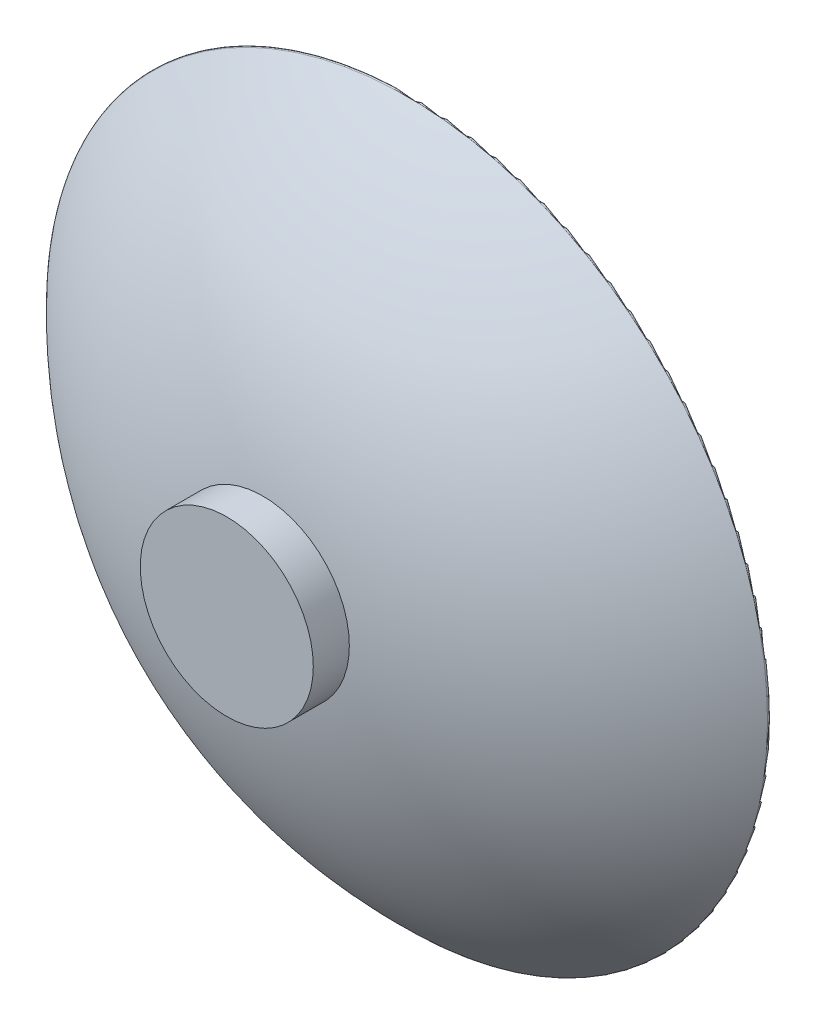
ISO-10303-21;
HEADER;
FILE_DESCRIPTION(('STEP AP214'),'2;1');
FILE_NAME('part.step','',(''),(''),'','','');
FILE_SCHEMA(('AUTOMOTIVE_DESIGN { 1 0 10303 214 1 1 1 1 }'));
ENDSEC;
DATA;
#1=APPLICATION_CONTEXT('core data for automotive mechanical design processes');
#2=APPLICATION_PROTOCOL_DEFINITION('international standard','automotive_design',2000,#1);
#3=PRODUCT_CONTEXT('',#1,'mechanical');
#4=PRODUCT('Part','Part','',(#3));
#5=PRODUCT_RELATED_PRODUCT_CATEGORY('part','',(#4));
#6=PRODUCT_DEFINITION_FORMATION('','',#4);
#7=PRODUCT_DEFINITION_CONTEXT('part definition',#1,'design');
#8=PRODUCT_DEFINITION('design','',#6,#7);
#9=PRODUCT_DEFINITION_SHAPE('','',#8);
#10=(LENGTH_UNIT() NAMED_UNIT(*) SI_UNIT(.MILLI.,.METRE.));
#11=(NAMED_UNIT(*) PLANE_ANGLE_UNIT() SI_UNIT($,.RADIAN.));
#12=(NAMED_UNIT(*) SI_UNIT($,.STERADIAN.) SOLID_ANGLE_UNIT());
#13=UNCERTAINTY_MEASURE_WITH_UNIT(LENGTH_MEASURE(1.E-05),#10,'distance_accuracy_value','');
#14=(GEOMETRIC_REPRESENTATION_CONTEXT(3) GLOBAL_UNCERTAINTY_ASSIGNED_CONTEXT((#13)) GLOBAL_UNIT_ASSIGNED_CONTEXT((#10,
#11,#12)) REPRESENTATION_CONTEXT('',''));
#15=CARTESIAN_POINT('',(0.,0.,0.));
#16=DIRECTION('',(0.,0.,1.));
#17=DIRECTION('',(1.,0.,0.));
#18=AXIS2_PLACEMENT_3D('',#15,#16,#17);
#19=CARTESIAN_POINT('',(0.,0.,-51.3767831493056));
#20=DIRECTION('',(0.,0.,1.));
#21=DIRECTION('',(0.,1.,0.));
#22=AXIS2_PLACEMENT_3D('',#19,#20,#21);
#23=SPHERICAL_SURFACE('',#22,50.);
#24=CARTESIAN_POINT('',(0.,0.,-1.37678314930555));
#25=VERTEX_POINT('',#24);
#26=VERTEX_LOOP('',#25);
#27=FACE_BOUND('',#26,.T.);
#28=ADVANCED_FACE('F41',(#27),#23,.T.);
#29=CLOSED_SHELL('',(#28));
#30=CARTESIAN_POINT('',(0.,0.,-51.3767831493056));
#31=DIRECTION('',(0.,0.,1.));
#32=DIRECTION('',(0.,1.,0.));
#33=AXIS2_PLACEMENT_3D('',#30,#31,#32);
#34=SPHERICAL_SURFACE('',#33,49.9);
#35=CARTESIAN_POINT('',(0.,0.,-1.47678314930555));
#36=VERTEX_POINT('',#35);
#37=VERTEX_LOOP('',#36);
#38=FACE_BOUND('',#37,.T.);
#39=ADVANCED_FACE('F43',(#38),#34,.F.);
#40=CLOSED_SHELL('',(#39));
#41=ORIENTED_CLOSED_SHELL('',*,#40,.T.);
#42=BREP_WITH_VOIDS('B2',#29,(#41));
#43=CARTESIAN_POINT('',(15.1411563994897,0.,-324.647109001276));
#44=DIRECTION('',(0.,-1.,0.));
#45=DIRECTION('',(1.,0.,0.));
#46=AXIS2_PLACEMENT_3D('',#43,#44,#45);
#47=CIRCLE('',#46,325.);
#48=TRIMMED_CURVE('',#47,(PARAMETER_VALUE(-1.61740136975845)),
(PARAMETER_VALUE(1.61740136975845)),.T.,.PARAMETER.);
#49=CARTESIAN_POINT('',(0.,0.,-324.647109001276));
#50=DIRECTION('',(0.,0.,1.));
#51=AXIS1_PLACEMENT('',#49,#50);
#52=SURFACE_OF_REVOLUTION('',#48,#51);
#53=CARTESIAN_POINT('',(0.,0.,0.));
#54=VERTEX_POINT('',#53);
#55=VERTEX_LOOP('',#54);
#56=FACE_BOUND('',#55,.T.);
#57=CARTESIAN_POINT('',(0.,0.,-100.));
#58=DIRECTION('',(0.,0.,1.));
#59=DIRECTION('',(1.,0.,0.));
#60=AXIS2_PLACEMENT_3D('',#57,#58,#59);
#61=CIRCLE('',#60,250.);
#62=CARTESIAN_POINT('',(250.,0.,-100.));
#63=VERTEX_POINT('',#62);
#64=EDGE_CURVE('E38',#63,#63,#61,.T.);
#65=ORIENTED_EDGE('',*,*,#64,.T.);
#66=EDGE_LOOP('',(#65));
#67=FACE_BOUND('',#66,.T.);
#68=ADVANCED_FACE('F72',(#56,#67),#52,.T.);
#69=CARTESIAN_POINT('',(0.,0.,-100.69122187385));
#70=DIRECTION('',(0.,0.,1.));
#71=DIRECTION('',(1.,0.,0.));
#72=AXIS2_PLACEMENT_3D('',#69,#70,#71);
#73=TOROIDAL_SURFACE('',#72,249.277357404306,0.999999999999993);
#74=ORIENTED_EDGE('',*,*,#64,.F.);
#75=EDGE_LOOP('',(#74));
#76=FACE_BOUND('',#75,.T.);
#77=CARTESIAN_POINT('',(0.,0.,-101.3824437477));
#78=DIRECTION('',(0.,0.,1.));
#79=DIRECTION('',(1.,0.,0.));
#80=AXIS2_PLACEMENT_3D('',#77,#78,#79);
#81=CIRCLE('',#80,248.554714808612);
#82=CARTESIAN_POINT('',(248.554714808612,0.,-101.3824437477));
#83=VERTEX_POINT('',#82);
#84=EDGE_CURVE('E78',#83,#83,#81,.T.);
#85=ORIENTED_EDGE('',*,*,#84,.T.);
#86=EDGE_LOOP('',(#85));
#87=FACE_BOUND('',#86,.T.);
#88=ADVANCED_FACE('F83',(#76,#87),#73,.T.);
#89=CARTESIAN_POINT('',(0.,0.,-99.9434961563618));
#90=DIRECTION('',(0.,0.,1.));
#91=DIRECTION('',(1.,0.,0.));
#92=AXIS2_PLACEMENT_3D('',#89,#90,#91);
#93=TOROIDAL_SURFACE('',#92,247.165675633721,2.00000000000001);
#94=ORIENTED_EDGE('',*,*,#84,.F.);
#95=EDGE_LOOP('',(#94));
#96=FACE_BOUND('',#95,.T.);
#97=CARTESIAN_POINT('',(0.,0.,-98.5090525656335));
#98=DIRECTION('',(0.,0.,1.));
#99=DIRECTION('',(1.,0.,0.));
#100=AXIS2_PLACEMENT_3D('',#97,#98,#99);
#101=CIRCLE('',#100,245.771985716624);
#102=CARTESIAN_POINT('',(245.771985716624,0.,-98.5090525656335));
#103=VERTEX_POINT('',#102);
#104=EDGE_CURVE('E92',#103,#103,#101,.T.);
#105=ORIENTED_EDGE('',*,*,#104,.T.);
#106=EDGE_LOOP('',(#105));
#107=FACE_BOUND('',#106,.T.);
#108=ADVANCED_FACE('F88',(#96,#107),#93,.T.);
#109=CARTESIAN_POINT('',(0.,0.,-324.647109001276));
#110=DIRECTION('',(0.,0.,1.));
#111=DIRECTION('',(1.,0.,0.));
#112=AXIS2_PLACEMENT_3D('',#109,#110,#111);
#113=DEGENERATE_TOROIDAL_SURFACE('',#112,15.1411563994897,322.999999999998,.T.);
#114=ORIENTED_EDGE('',*,*,#104,.F.);
#115=EDGE_LOOP('',(#114));
#116=FACE_BOUND('',#115,.T.);
#117=CARTESIAN_POINT('',(0.,0.,-97.8724129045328));
#118=DIRECTION('',(0.,0.,1.));
#119=DIRECTION('',(1.,0.,0.));
#120=AXIS2_PLACEMENT_3D('',#117,#118,#119);
#121=CIRCLE('',#120,245.146019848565);
#122=CARTESIAN_POINT('',(245.146019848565,0.,-97.8724129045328));
#123=VERTEX_POINT('',#122);
#124=EDGE_CURVE('E94',#123,#123,#121,.T.);
#125=ORIENTED_EDGE('',*,*,#124,.T.);
#126=EDGE_LOOP('',(#125));
#127=FACE_BOUND('',#126,.T.);
#128=ADVANCED_FACE('F848',(#116,#127),#113,.F.);
#129=CARTESIAN_POINT('',(0.,0.,-96.4546709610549));
#130=DIRECTION('',(0.,0.,1.));
#131=DIRECTION('',(1.,0.,0.));
#132=AXIS2_PLACEMENT_3D('',#129,#130,#131);
#133=TOROIDAL_SURFACE('',#132,243.735343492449,2.00000000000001);
#134=ORIENTED_EDGE('',*,*,#124,.F.);
#135=EDGE_LOOP('',(#134));
#136=FACE_BOUND('',#135,.T.);
#137=CARTESIAN_POINT('',(0.,0.,-95.0415029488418));
#138=DIRECTION('',(0.,0.,1.));
#139=DIRECTION('',(1.,0.,0.));
#140=AXIS2_PLACEMENT_3D('',#137,#138,#139);
#141=CIRCLE('',#140,242.320085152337);
#142=CARTESIAN_POINT('',(242.320085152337,0.,-95.0415029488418));
#143=VERTEX_POINT('',#142);
#144=EDGE_CURVE('E99',#143,#143,#141,.T.);
#145=ORIENTED_EDGE('',*,*,#144,.T.);
#146=EDGE_LOOP('',(#145));
#147=FACE_BOUND('',#146,.T.);
#148=ADVANCED_FACE('F844',(#136,#147),#133,.T.);
#149=CARTESIAN_POINT('',(0.,0.,-324.647109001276));
#150=DIRECTION('',(0.,0.,1.));
#151=DIRECTION('',(1.,0.,0.));
#152=AXIS2_PLACEMENT_3D('',#149,#150,#151);
#153=DEGENERATE_TOROIDAL_SURFACE('',#152,15.1411563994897,322.999999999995,.T.);
#154=ORIENTED_EDGE('',*,*,#144,.F.);
#155=EDGE_LOOP('',(#154));
#156=FACE_BOUND('',#155,.T.);
#157=CARTESIAN_POINT('',(0.,0.,-94.4144181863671));
#158=DIRECTION('',(0.,0.,1.));
#159=DIRECTION('',(1.,0.,0.));
#160=AXIS2_PLACEMENT_3D('',#157,#158,#159);
#161=CIRCLE('',#160,241.684547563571);
#162=CARTESIAN_POINT('',(241.684547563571,0.,-94.4144181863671));
#163=VERTEX_POINT('',#162);
#164=EDGE_CURVE('E102',#163,#163,#161,.T.);
#165=ORIENTED_EDGE('',*,*,#164,.T.);
#166=EDGE_LOOP('',(#165));
#167=FACE_BOUND('',#166,.T.);
#168=ADVANCED_FACE('F840',(#156,#167),#153,.F.);
#169=CARTESIAN_POINT('',(0.,0.,-93.0182072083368));
#170=DIRECTION('',(0.,0.,1.));
#171=DIRECTION('',(1.,0.,0.));
#172=AXIS2_PLACEMENT_3D('',#169,#170,#171);
#173=TOROIDAL_SURFACE('',#172,240.252557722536,2.00000000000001);
#174=ORIENTED_EDGE('',*,*,#164,.F.);
#175=EDGE_LOOP('',(#174));
#176=FACE_BOUND('',#175,.T.);
#177=CARTESIAN_POINT('',(0.,0.,-91.6266390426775));
#178=DIRECTION('',(0.,0.,1.));
#179=DIRECTION('',(1.,0.,0.));
#180=AXIS2_PLACEMENT_3D('',#177,#178,#179);
#181=CIRCLE('',#180,238.81605570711);
#182=CARTESIAN_POINT('',(238.81605570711,0.,-91.6266390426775));
#183=VERTEX_POINT('',#182);
#184=EDGE_CURVE('E105',#183,#183,#181,.T.);
#185=ORIENTED_EDGE('',*,*,#184,.T.);
#186=EDGE_LOOP('',(#185));
#187=FACE_BOUND('',#186,.T.);
#188=ADVANCED_FACE('F836',(#176,#187),#173,.T.);
#189=CARTESIAN_POINT('',(0.,0.,-324.647109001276));
#190=DIRECTION('',(0.,0.,1.));
#191=DIRECTION('',(1.,0.,0.));
#192=AXIS2_PLACEMENT_3D('',#189,#190,#191);
#193=DEGENERATE_TOROIDAL_SURFACE('',#192,15.1411563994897,323.,.T.);
#194=ORIENTED_EDGE('',*,*,#184,.F.);
#195=EDGE_LOOP('',(#194));
#196=FACE_BOUND('',#195,.T.);
#197=CARTESIAN_POINT('',(0.,0.,-91.0092530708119));
#198=DIRECTION('',(0.,0.,1.));
#199=DIRECTION('',(1.,0.,0.));
#200=AXIS2_PLACEMENT_3D('',#197,#198,#199);
#201=CIRCLE('',#200,238.171092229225);
#202=CARTESIAN_POINT('',(238.171092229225,0.,-91.0092530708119));
#203=VERTEX_POINT('',#202);
#204=EDGE_CURVE('E108',#203,#203,#201,.T.);
#205=ORIENTED_EDGE('',*,*,#204,.T.);
#206=EDGE_LOOP('',(#205));
#207=FACE_BOUND('',#206,.T.);
#208=ADVANCED_FACE('F832',(#196,#207),#193,.F.);
#209=CARTESIAN_POINT('',(0.,0.,-89.6348934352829));
#210=DIRECTION('',(0.,0.,1.));
#211=DIRECTION('',(1.,0.,0.));
#212=AXIS2_PLACEMENT_3D('',#209,#210,#211);
#213=TOROIDAL_SURFACE('',#212,236.718117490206,2.00000000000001);
#214=ORIENTED_EDGE('',*,*,#204,.F.);
#215=EDGE_LOOP('',(#214));
#216=FACE_BOUND('',#215,.T.);
#217=CARTESIAN_POINT('',(0.,0.,-88.2652444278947));
#218=DIRECTION('',(0.,0.,1.));
#219=DIRECTION('',(1.,0.,0.));
#220=AXIS2_PLACEMENT_3D('',#217,#218,#219);
#221=CIRCLE('',#220,235.260701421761);
#222=CARTESIAN_POINT('',(235.260701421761,0.,-88.2652444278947));
#223=VERTEX_POINT('',#222);
#224=EDGE_CURVE('E111',#223,#223,#221,.T.);
#225=ORIENTED_EDGE('',*,*,#224,.T.);
#226=EDGE_LOOP('',(#225));
#227=FACE_BOUND('',#226,.T.);
#228=ADVANCED_FACE('F828',(#216,#227),#213,.T.);
#229=CARTESIAN_POINT('',(0.,0.,-324.647109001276));
#230=DIRECTION('',(0.,0.,1.));
#231=DIRECTION('',(1.,0.,0.));
#232=AXIS2_PLACEMENT_3D('',#229,#230,#231);
#233=DEGENERATE_TOROIDAL_SURFACE('',#232,15.1411563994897,323.,.T.);
#234=ORIENTED_EDGE('',*,*,#224,.F.);
#235=EDGE_LOOP('',(#234));
#236=FACE_BOUND('',#235,.T.);
#237=CARTESIAN_POINT('',(0.,0.,-87.6576989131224));
#238=DIRECTION('',(0.,0.,1.));
#239=DIRECTION('',(1.,0.,0.));
#240=AXIS2_PLACEMENT_3D('',#237,#238,#239);
#241=CIRCLE('',#240,234.606460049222);
#242=CARTESIAN_POINT('',(234.606460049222,0.,-87.6576989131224));
#243=VERTEX_POINT('',#242);
#244=EDGE_CURVE('E114',#243,#243,#241,.T.);
#245=ORIENTED_EDGE('',*,*,#244,.T.);
#246=EDGE_LOOP('',(#245));
#247=FACE_BOUND('',#246,.T.);
#248=ADVANCED_FACE('F824',(#236,#247),#233,.F.);
#249=CARTESIAN_POINT('',(0.,0.,-86.3055059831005));
#250=DIRECTION('',(0.,0.,1.));
#251=DIRECTION('',(1.,0.,0.));
#252=AXIS2_PLACEMENT_3D('',#249,#250,#251);
#253=TOROIDAL_SURFACE('',#252,233.132833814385,2.00000000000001);
#254=ORIENTED_EDGE('',*,*,#244,.F.);
#255=EDGE_LOOP('',(#254));
#256=FACE_BOUND('',#255,.T.);
#257=CARTESIAN_POINT('',(0.,0.,-84.9580904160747));
#258=DIRECTION('',(0.,0.,1.));
#259=DIRECTION('',(1.,0.,0.));
#260=AXIS2_PLACEMENT_3D('',#257,#258,#259);
#261=CIRCLE('',#260,231.65483811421);
#262=CARTESIAN_POINT('',(231.65483811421,0.,-84.9580904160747));
#263=VERTEX_POINT('',#262);
#264=EDGE_CURVE('E117',#263,#263,#261,.T.);
#265=ORIENTED_EDGE('',*,*,#264,.T.);
#266=EDGE_LOOP('',(#265));
#267=FACE_BOUND('',#266,.T.);
#268=ADVANCED_FACE('F820',(#256,#267),#253,.T.);
#269=CARTESIAN_POINT('',(0.,0.,-324.647109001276));
#270=DIRECTION('',(0.,0.,1.));
#271=DIRECTION('',(1.,0.,0.));
#272=AXIS2_PLACEMENT_3D('',#269,#270,#271);
#273=DEGENERATE_TOROIDAL_SURFACE('',#272,15.1411563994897,323.,.T.);
#274=ORIENTED_EDGE('',*,*,#264,.F.);
#275=EDGE_LOOP('',(#274));
#276=FACE_BOUND('',#275,.T.);
#277=CARTESIAN_POINT('',(0.,0.,-84.36052476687));
#278=DIRECTION('',(0.,0.,1.));
#279=DIRECTION('',(1.,0.,0.));
#280=AXIS2_PLACEMENT_3D('',#277,#278,#279);
#281=CIRCLE('',#280,230.991468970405);
#282=CARTESIAN_POINT('',(230.991468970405,0.,-84.36052476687));
#283=VERTEX_POINT('',#282);
#284=EDGE_CURVE('E120',#283,#283,#281,.T.);
#285=ORIENTED_EDGE('',*,*,#284,.T.);
#286=EDGE_LOOP('',(#285));
#287=FACE_BOUND('',#286,.T.);
#288=ADVANCED_FACE('F816',(#276,#287),#273,.F.);
#289=CARTESIAN_POINT('',(0.,0.,-83.0308088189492));
#290=DIRECTION('',(0.,0.,1.));
#291=DIRECTION('',(1.,0.,0.));
#292=AXIS2_PLACEMENT_3D('',#289,#290,#291);
#293=TOROIDAL_SURFACE('',#292,229.497529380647,2.00000000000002);
#294=ORIENTED_EDGE('',*,*,#284,.F.);
#295=EDGE_LOOP('',(#294));
#296=FACE_BOUND('',#295,.T.);
#297=CARTESIAN_POINT('',(0.,0.,-81.7059358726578));
#298=DIRECTION('',(0.,0.,1.));
#299=DIRECTION('',(1.,0.,0.));
#300=AXIS2_PLACEMENT_3D('',#297,#298,#299);
#301=CIRCLE('',#300,227.999293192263);
#302=CARTESIAN_POINT('',(227.999293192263,0.,-81.7059358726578));
#303=VERTEX_POINT('',#302);
#304=EDGE_CURVE('E123',#303,#303,#301,.T.);
#305=ORIENTED_EDGE('',*,*,#304,.T.);
#306=EDGE_LOOP('',(#305));
#307=FACE_BOUND('',#306,.T.);
#308=ADVANCED_FACE('F812',(#296,#307),#293,.T.);
#309=CARTESIAN_POINT('',(0.,0.,-324.647109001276));
#310=DIRECTION('',(0.,0.,1.));
#311=DIRECTION('',(1.,0.,0.));
#312=AXIS2_PLACEMENT_3D('',#309,#310,#311);
#313=DEGENERATE_TOROIDAL_SURFACE('',#312,15.1411563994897,323.,.T.);
#314=ORIENTED_EDGE('',*,*,#304,.F.);
#315=EDGE_LOOP('',(#314));
#316=FACE_BOUND('',#315,.T.);
#317=CARTESIAN_POINT('',(0.,0.,-81.118487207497));
#318=DIRECTION('',(0.,0.,1.));
#319=DIRECTION('',(1.,0.,0.));
#320=AXIS2_PLACEMENT_3D('',#317,#318,#319);
#321=CIRCLE('',#320,227.326948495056);
#322=CARTESIAN_POINT('',(227.326948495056,0.,-81.118487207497));
#323=VERTEX_POINT('',#322);
#324=EDGE_CURVE('E126',#323,#323,#321,.T.);
#325=ORIENTED_EDGE('',*,*,#324,.T.);
#326=EDGE_LOOP('',(#325));
#327=FACE_BOUND('',#326,.T.);
#328=ADVANCED_FACE('F808',(#316,#327),#313,.F.);
#329=CARTESIAN_POINT('',(0.,0.,-79.8115533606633));
#330=DIRECTION('',(0.,0.,1.));
#331=DIRECTION('',(1.,0.,0.));
#332=AXIS2_PLACEMENT_3D('',#329,#330,#331);
#333=TOROIDAL_SURFACE('',#332,225.813038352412,2.00000000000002);
#334=ORIENTED_EDGE('',*,*,#324,.F.);
#335=EDGE_LOOP('',(#334));
#336=FACE_BOUND('',#335,.T.);
#337=CARTESIAN_POINT('',(0.,0.,-78.5095270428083));
#338=DIRECTION('',(0.,0.,1.));
#339=DIRECTION('',(1.,0.,0.));
#340=AXIS2_PLACEMENT_3D('',#337,#338,#339);
#341=CIRCLE('',#340,224.294905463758);
#342=CARTESIAN_POINT('',(224.294905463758,0.,-78.5095270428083));
#343=VERTEX_POINT('',#342);
#344=EDGE_CURVE('E129',#343,#343,#341,.T.);
#345=ORIENTED_EDGE('',*,*,#344,.T.);
#346=EDGE_LOOP('',(#345));
#347=FACE_BOUND('',#346,.T.);
#348=ADVANCED_FACE('F804',(#336,#347),#333,.T.);
#349=CARTESIAN_POINT('',(0.,0.,-324.647109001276));
#350=DIRECTION('',(0.,0.,1.));
#351=DIRECTION('',(1.,0.,0.));
#352=AXIS2_PLACEMENT_3D('',#349,#350,#351);
#353=DEGENERATE_TOROIDAL_SURFACE('',#352,15.1411563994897,323.,.T.);
#354=ORIENTED_EDGE('',*,*,#344,.F.);
#355=EDGE_LOOP('',(#354));
#356=FACE_BOUND('',#355,.T.);
#357=CARTESIAN_POINT('',(0.,0.,-77.9323301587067));
#358=DIRECTION('',(0.,0.,1.));
#359=DIRECTION('',(1.,0.,0.));
#360=AXIS2_PLACEMENT_3D('',#357,#358,#359);
#361=CIRCLE('',#360,223.613739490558);
#362=CARTESIAN_POINT('',(223.613739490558,0.,-77.9323301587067));
#363=VERTEX_POINT('',#362);
#364=EDGE_CURVE('E132',#363,#363,#361,.T.);
#365=ORIENTED_EDGE('',*,*,#364,.T.);
#366=EDGE_LOOP('',(#365));
#367=FACE_BOUND('',#366,.T.);
#368=ADVANCED_FACE('F800',(#356,#367),#353,.F.);
#369=CARTESIAN_POINT('',(0.,0.,-76.6484783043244));
#370=DIRECTION('',(0.,0.,1.));
#371=DIRECTION('',(1.,0.,0.));
#372=AXIS2_PLACEMENT_3D('',#369,#370,#371);
#373=TOROIDAL_SURFACE('',#372,222.080206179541,2.00000000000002);
#374=ORIENTED_EDGE('',*,*,#364,.F.);
#375=EDGE_LOOP('',(#374));
#376=FACE_BOUND('',#375,.T.);
#377=CARTESIAN_POINT('',(0.,0.,-75.3695973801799));
#378=DIRECTION('',(0.,0.,1.));
#379=DIRECTION('',(1.,0.,0.));
#380=AXIS2_PLACEMENT_3D('',#377,#378,#379);
#381=CIRCLE('',#380,220.542524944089);
#382=CARTESIAN_POINT('',(220.542524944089,0.,-75.3695973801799));
#383=VERTEX_POINT('',#382);
#384=EDGE_CURVE('E135',#383,#383,#381,.T.);
#385=ORIENTED_EDGE('',*,*,#384,.T.);
#386=EDGE_LOOP('',(#385));
#387=FACE_BOUND('',#386,.T.);
#388=ADVANCED_FACE('F796',(#376,#387),#373,.T.);
#389=CARTESIAN_POINT('',(0.,0.,-324.647109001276));
#390=DIRECTION('',(0.,0.,1.));
#391=DIRECTION('',(1.,0.,0.));
#392=AXIS2_PLACEMENT_3D('',#389,#390,#391);
#393=DEGENERATE_TOROIDAL_SURFACE('',#392,15.1411563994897,323.,.T.);
#394=ORIENTED_EDGE('',*,*,#384,.F.);
#395=EDGE_LOOP('',(#394));
#396=FACE_BOUND('',#395,.T.);
#397=CARTESIAN_POINT('',(0.,0.,-74.8027847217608));
#398=DIRECTION('',(0.,0.,1.));
#399=DIRECTION('',(1.,0.,0.));
#400=AXIS2_PLACEMENT_3D('',#397,#398,#399);
#401=CIRCLE('',#400,219.852693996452);
#402=CARTESIAN_POINT('',(219.852693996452,0.,-74.8027847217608));
#403=VERTEX_POINT('',#402);
#404=EDGE_CURVE('E138',#403,#403,#401,.T.);
#405=ORIENTED_EDGE('',*,*,#404,.T.);
#406=EDGE_LOOP('',(#405));
#407=FACE_BOUND('',#406,.T.);
#408=ADVANCED_FACE('F792',(#396,#407),#393,.F.);
#409=CARTESIAN_POINT('',(0.,0.,-73.5423094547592));
#410=DIRECTION('',(0.,0.,1.));
#411=DIRECTION('',(1.,0.,0.));
#412=AXIS2_PLACEMENT_3D('',#409,#410,#411);
#413=TOROIDAL_SURFACE('',#412,218.299889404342,2.00000000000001);
#414=ORIENTED_EDGE('',*,*,#404,.F.);
#415=EDGE_LOOP('',(#414));
#416=FACE_BOUND('',#415,.T.);
#417=CARTESIAN_POINT('',(0.,0.,-72.2868673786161));
#418=DIRECTION('',(0.,0.,1.));
#419=DIRECTION('',(1.,0.,0.));
#420=AXIS2_PLACEMENT_3D('',#417,#418,#419);
#421=CIRCLE('',#420,216.743012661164);
#422=CARTESIAN_POINT('',(216.743012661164,0.,-72.2868673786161));
#423=VERTEX_POINT('',#422);
#424=EDGE_CURVE('E141',#423,#423,#421,.T.);
#425=ORIENTED_EDGE('',*,*,#424,.T.);
#426=EDGE_LOOP('',(#425));
#427=FACE_BOUND('',#426,.T.);
#428=ADVANCED_FACE('F788',(#416,#427),#413,.T.);
#429=CARTESIAN_POINT('',(0.,0.,-324.647109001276));
#430=DIRECTION('',(0.,0.,1.));
#431=DIRECTION('',(1.,0.,0.));
#432=AXIS2_PLACEMENT_3D('',#429,#430,#431);
#433=DEGENERATE_TOROIDAL_SURFACE('',#432,15.1411563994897,323.,.T.);
#434=ORIENTED_EDGE('',*,*,#424,.F.);
#435=EDGE_LOOP('',(#434));
#436=FACE_BOUND('',#435,.T.);
#437=CARTESIAN_POINT('',(0.,0.,-71.73056900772));
#438=DIRECTION('',(0.,0.,1.));
#439=DIRECTION('',(1.,0.,0.));
#440=AXIS2_PLACEMENT_3D('',#437,#438,#439);
#441=CIRCLE('',#440,216.044675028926);
#442=CARTESIAN_POINT('',(216.044675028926,0.,-71.73056900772));
#443=VERTEX_POINT('',#442);
#444=EDGE_CURVE('E144',#443,#443,#441,.T.);
#445=ORIENTED_EDGE('',*,*,#444,.T.);
#446=EDGE_LOOP('',(#445));
#447=FACE_BOUND('',#446,.T.);
#448=ADVANCED_FACE('F784',(#436,#447),#433,.F.);
#449=CARTESIAN_POINT('',(0.,0.,-70.4937595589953));
#450=DIRECTION('',(0.,0.,1.));
#451=DIRECTION('',(1.,0.,0.));
#452=AXIS2_PLACEMENT_3D('',#449,#450,#451);
#453=TOROIDAL_SURFACE('',#452,214.472955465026,2.00000000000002);
#454=ORIENTED_EDGE('',*,*,#444,.F.);
#455=EDGE_LOOP('',(#454));
#456=FACE_BOUND('',#455,.T.);
#457=CARTESIAN_POINT('',(0.,0.,-69.2620444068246));
#458=DIRECTION('',(0.,0.,1.));
#459=DIRECTION('',(1.,0.,0.));
#460=AXIS2_PLACEMENT_3D('',#457,#458,#459);
#461=CIRCLE('',#460,212.897240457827);
#462=CARTESIAN_POINT('',(212.897240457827,0.,-69.2620444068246));
#463=VERTEX_POINT('',#462);
#464=EDGE_CURVE('E147',#463,#463,#461,.T.);
#465=ORIENTED_EDGE('',*,*,#464,.T.);
#466=EDGE_LOOP('',(#465));
#467=FACE_BOUND('',#466,.T.);
#468=ADVANCED_FACE('F780',(#456,#467),#453,.T.);
#469=CARTESIAN_POINT('',(0.,0.,-324.647109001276));
#470=DIRECTION('',(0.,0.,1.));
#471=DIRECTION('',(1.,0.,0.));
#472=AXIS2_PLACEMENT_3D('',#469,#470,#471);
#473=DEGENERATE_TOROIDAL_SURFACE('',#472,15.1411563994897,323.,.T.);
#474=ORIENTED_EDGE('',*,*,#464,.F.);
#475=EDGE_LOOP('',(#474));
#476=FACE_BOUND('',#475,.T.);
#477=CARTESIAN_POINT('',(0.,0.,-68.716387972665));
#478=DIRECTION('',(0.,0.,1.));
#479=DIRECTION('',(1.,0.,0.));
#480=AXIS2_PLACEMENT_3D('',#477,#478,#479);
#481=CIRCLE('',#480,212.190556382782);
#482=CARTESIAN_POINT('',(212.190556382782,0.,-68.716387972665));
#483=VERTEX_POINT('',#482);
#484=EDGE_CURVE('E150',#483,#483,#481,.T.);
#485=ORIENTED_EDGE('',*,*,#484,.T.);
#486=EDGE_LOOP('',(#485));
#487=FACE_BOUND('',#486,.T.);
#488=ADVANCED_FACE('F776',(#476,#487),#473,.F.);
#489=CARTESIAN_POINT('',(0.,0.,-67.5035281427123));
#490=DIRECTION('',(0.,0.,1.));
#491=DIRECTION('',(1.,0.,0.));
#492=AXIS2_PLACEMENT_3D('',#489,#490,#491);
#493=TOROIDAL_SURFACE('',#492,210.600282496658,2.00000000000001);
#494=ORIENTED_EDGE('',*,*,#484,.F.);
#495=EDGE_LOOP('',(#494));
#496=FACE_BOUND('',#495,.T.);
#497=CARTESIAN_POINT('',(0.,0.,-66.2958225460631));
#498=DIRECTION('',(0.,0.,1.));
#499=DIRECTION('',(1.,0.,0.));
#500=AXIS2_PLACEMENT_3D('',#497,#498,#499);
#501=CIRCLE('',#500,209.006090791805);
#502=CARTESIAN_POINT('',(209.006090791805,0.,-66.2958225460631));
#503=VERTEX_POINT('',#502);
#504=EDGE_CURVE('E153',#503,#503,#501,.T.);
#505=ORIENTED_EDGE('',*,*,#504,.T.);
#506=EDGE_LOOP('',(#505));
#507=FACE_BOUND('',#506,.T.);
#508=ADVANCED_FACE('F772',(#496,#507),#493,.T.);
#509=CARTESIAN_POINT('',(0.,0.,-324.647109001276));
#510=DIRECTION('',(0.,0.,1.));
#511=DIRECTION('',(1.,0.,0.));
#512=AXIS2_PLACEMENT_3D('',#509,#510,#511);
#513=DEGENERATE_TOROIDAL_SURFACE('',#512,15.1411563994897,323.,.T.);
#514=ORIENTED_EDGE('',*,*,#504,.F.);
#515=EDGE_LOOP('',(#514));
#516=FACE_BOUND('',#515,.T.);
#517=CARTESIAN_POINT('',(0.,0.,-65.7609332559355));
#518=DIRECTION('',(0.,0.,1.));
#519=DIRECTION('',(1.,0.,0.));
#520=AXIS2_PLACEMENT_3D('',#517,#518,#519);
#521=CIRCLE('',#520,208.291222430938);
#522=CARTESIAN_POINT('',(208.291222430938,0.,-65.7609332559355));
#523=VERTEX_POINT('',#522);
#524=EDGE_CURVE('E156',#523,#523,#521,.T.);
#525=ORIENTED_EDGE('',*,*,#524,.T.);
#526=EDGE_LOOP('',(#525));
#527=FACE_BOUND('',#526,.T.);
#528=ADVANCED_FACE('F768',(#516,#527),#513,.F.);
#529=CARTESIAN_POINT('',(0.,0.,-64.5723013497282));
#530=DIRECTION('',(0.,0.,1.));
#531=DIRECTION('',(1.,0.,0.));
#532=AXIS2_PLACEMENT_3D('',#529,#530,#531);
#533=TOROIDAL_SURFACE('',#532,206.682759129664,2.);
#534=ORIENTED_EDGE('',*,*,#524,.F.);
#535=EDGE_LOOP('',(#534));
#536=FACE_BOUND('',#535,.T.);
#537=CARTESIAN_POINT('',(0.,0.,-63.3888824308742));
#538=DIRECTION('',(0.,0.,1.));
#539=DIRECTION('',(1.,0.,0.));
#540=AXIS2_PLACEMENT_3D('',#537,#538,#539);
#541=CIRCLE('',#540,205.07045653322);
#542=CARTESIAN_POINT('',(205.07045653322,0.,-63.3888824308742));
#543=VERTEX_POINT('',#542);
#544=EDGE_CURVE('E159',#543,#543,#541,.T.);
#545=ORIENTED_EDGE('',*,*,#544,.T.);
#546=EDGE_LOOP('',(#545));
#547=FACE_BOUND('',#546,.T.);
#548=ADVANCED_FACE('F764',(#536,#547),#533,.T.);
#549=CARTESIAN_POINT('',(0.,0.,-324.647109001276));
#550=DIRECTION('',(0.,0.,1.));
#551=DIRECTION('',(1.,0.,0.));
#552=AXIS2_PLACEMENT_3D('',#549,#550,#551);
#553=DEGENERATE_TOROIDAL_SURFACE('',#552,15.1411563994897,323.,.T.);
#554=ORIENTED_EDGE('',*,*,#544,.F.);
#555=EDGE_LOOP('',(#554));
#556=FACE_BOUND('',#555,.T.);
#557=CARTESIAN_POINT('',(0.,0.,-62.8648830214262));
#558=DIRECTION('',(0.,0.,1.));
#559=DIRECTION('',(1.,0.,0.));
#560=AXIS2_PLACEMENT_3D('',#557,#558,#559);
#561=CIRCLE('',#560,204.347567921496);
#562=CARTESIAN_POINT('',(204.347567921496,0.,-62.8648830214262));
#563=VERTEX_POINT('',#562);
#564=EDGE_CURVE('E162',#563,#563,#561,.T.);
#565=ORIENTED_EDGE('',*,*,#564,.T.);
#566=EDGE_LOOP('',(#565));
#567=FACE_BOUND('',#566,.T.);
#568=ADVANCED_FACE('F760',(#556,#567),#553,.F.);
#569=CARTESIAN_POINT('',(0.,0.,-61.7007517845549));
#570=DIRECTION('',(0.,0.,1.));
#571=DIRECTION('',(1.,0.,0.));
#572=AXIS2_PLACEMENT_3D('',#569,#570,#571);
#573=TOROIDAL_SURFACE('',#572,202.721284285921,1.99999999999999);
#574=ORIENTED_EDGE('',*,*,#564,.F.);
#575=EDGE_LOOP('',(#574));
#576=FACE_BOUND('',#575,.T.);
#577=CARTESIAN_POINT('',(0.,0.,-60.5418910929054));
#578=DIRECTION('',(0.,0.,1.));
#579=DIRECTION('',(1.,0.,0.));
#580=AXIS2_PLACEMENT_3D('',#577,#578,#579);
#581=CIRCLE('',#580,201.091240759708);
#582=CARTESIAN_POINT('',(201.091240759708,0.,-60.5418910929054));
#583=VERTEX_POINT('',#582);
#584=EDGE_CURVE('E165',#583,#583,#581,.T.);
#585=ORIENTED_EDGE('',*,*,#584,.T.);
#586=EDGE_LOOP('',(#585));
#587=FACE_BOUND('',#586,.T.);
#588=ADVANCED_FACE('F756',(#576,#587),#573,.T.);
#589=CARTESIAN_POINT('',(0.,0.,-324.647109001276));
#590=DIRECTION('',(0.,0.,1.));
#591=DIRECTION('',(1.,0.,0.));
#592=AXIS2_PLACEMENT_3D('',#589,#590,#591);
#593=DEGENERATE_TOROIDAL_SURFACE('',#592,15.1411563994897,323.,.T.);
#594=ORIENTED_EDGE('',*,*,#584,.F.);
#595=EDGE_LOOP('',(#594));
#596=FACE_BOUND('',#595,.T.);
#597=CARTESIAN_POINT('',(0.,0.,-60.0289018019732));
#598=DIRECTION('',(0.,0.,1.));
#599=DIRECTION('',(1.,0.,0.));
#600=AXIS2_PLACEMENT_3D('',#597,#598,#599);
#601=CIRCLE('',#600,200.360497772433);
#602=CARTESIAN_POINT('',(200.360497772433,0.,-60.0289018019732));
#603=VERTEX_POINT('',#602);
#604=EDGE_CURVE('E168',#603,#603,#601,.T.);
#605=ORIENTED_EDGE('',*,*,#604,.T.);
#606=EDGE_LOOP('',(#605));
#607=FACE_BOUND('',#606,.T.);
#608=ADVANCED_FACE('F752',(#596,#607),#593,.F.);
#609=CARTESIAN_POINT('',(0.,0.,-58.8895383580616));
#610=DIRECTION('',(0.,0.,1.));
#611=DIRECTION('',(1.,0.,0.));
#612=AXIS2_PLACEMENT_3D('',#609,#610,#611);
#613=TOROIDAL_SURFACE('',#612,198.716766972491,1.99999999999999);
#614=ORIENTED_EDGE('',*,*,#604,.F.);
#615=EDGE_LOOP('',(#614));
#616=FACE_BOUND('',#615,.T.);
#617=CARTESIAN_POINT('',(0.,0.,-57.7555018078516));
#618=DIRECTION('',(0.,0.,1.));
#619=DIRECTION('',(1.,0.,0.));
#620=AXIS2_PLACEMENT_3D('',#617,#618,#619);
#621=CIRCLE('',#620,197.069356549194);
#622=CARTESIAN_POINT('',(197.069356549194,0.,-57.7555018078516));
#623=VERTEX_POINT('',#622);
#624=EDGE_CURVE('E171',#623,#623,#621,.T.);
#625=ORIENTED_EDGE('',*,*,#624,.T.);
#626=EDGE_LOOP('',(#625));
#627=FACE_BOUND('',#626,.T.);
#628=ADVANCED_FACE('F748',(#616,#627),#613,.T.);
#629=CARTESIAN_POINT('',(0.,0.,-324.647109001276));
#630=DIRECTION('',(0.,0.,1.));
#631=DIRECTION('',(1.,0.,0.));
#632=AXIS2_PLACEMENT_3D('',#629,#630,#631);
#633=DEGENERATE_TOROIDAL_SURFACE('',#632,15.1411563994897,323.,.T.);
#634=ORIENTED_EDGE('',*,*,#624,.F.);
#635=EDGE_LOOP('',(#634));
#636=FACE_BOUND('',#635,.T.);
#637=CARTESIAN_POINT('',(0.,0.,-57.2536403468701));
#638=DIRECTION('',(0.,0.,1.));
#639=DIRECTION('',(1.,0.,0.));
#640=AXIS2_PLACEMENT_3D('',#637,#638,#639);
#641=CIRCLE('',#640,196.330926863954);
#642=CARTESIAN_POINT('',(196.330926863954,0.,-57.2536403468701));
#643=VERTEX_POINT('',#642);
#644=EDGE_CURVE('E174',#643,#643,#641,.T.);
#645=ORIENTED_EDGE('',*,*,#644,.T.);
#646=EDGE_LOOP('',(#645));
#647=FACE_BOUND('',#646,.T.);
#648=ADVANCED_FACE('F744',(#636,#647),#633,.F.);
#649=CARTESIAN_POINT('',(0.,0.,-56.13930613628));
#650=DIRECTION('',(0.,0.,1.));
#651=DIRECTION('',(1.,0.,0.));
#652=AXIS2_PLACEMENT_3D('',#649,#650,#651);
#653=TOROIDAL_SURFACE('',#652,194.670126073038,2.00000000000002);
#654=ORIENTED_EDGE('',*,*,#644,.F.);
#655=EDGE_LOOP('',(#654));
#656=FACE_BOUND('',#655,.T.);
#657=CARTESIAN_POINT('',(0.,0.,-55.0303539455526));
#658=DIRECTION('',(0.,0.,1.));
#659=DIRECTION('',(1.,0.,0.));
#660=AXIS2_PLACEMENT_3D('',#657,#658,#659);
#661=CIRCLE('',#660,193.005726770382);
#662=CARTESIAN_POINT('',(193.005726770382,0.,-55.0303539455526));
#663=VERTEX_POINT('',#662);
#664=EDGE_CURVE('E177',#663,#663,#661,.T.);
#665=ORIENTED_EDGE('',*,*,#664,.T.);
#666=EDGE_LOOP('',(#665));
#667=FACE_BOUND('',#666,.T.);
#668=ADVANCED_FACE('F740',(#656,#667),#653,.T.);
#669=CARTESIAN_POINT('',(0.,0.,-324.647109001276));
#670=DIRECTION('',(0.,0.,1.));
#671=DIRECTION('',(1.,0.,0.));
#672=AXIS2_PLACEMENT_3D('',#669,#670,#671);
#673=DEGENERATE_TOROIDAL_SURFACE('',#672,15.1411563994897,323.,.T.);
#674=ORIENTED_EDGE('',*,*,#664,.F.);
#675=EDGE_LOOP('',(#674));
#676=FACE_BOUND('',#675,.T.);
#677=CARTESIAN_POINT('',(0.,0.,-54.5397354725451));
#678=DIRECTION('',(0.,0.,1.));
#679=DIRECTION('',(1.,0.,0.));
#680=AXIS2_PLACEMENT_3D('',#677,#678,#679);
#681=CIRCLE('',#680,192.259779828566);
#682=CARTESIAN_POINT('',(192.259779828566,0.,-54.5397354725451));
#683=VERTEX_POINT('',#682);
#684=EDGE_CURVE('E180',#683,#683,#681,.T.);
#685=ORIENTED_EDGE('',*,*,#684,.T.);
#686=EDGE_LOOP('',(#685));
#687=FACE_BOUND('',#686,.T.);
#688=ADVANCED_FACE('F736',(#676,#687),#673,.F.);
#689=CARTESIAN_POINT('',(0.,0.,-53.4506861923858));
#690=DIRECTION('',(0.,0.,1.));
#691=DIRECTION('',(1.,0.,0.));
#692=AXIS2_PLACEMENT_3D('',#689,#690,#691);
#693=TOROIDAL_SURFACE('',#692,190.582290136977,2.00000000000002);
#694=ORIENTED_EDGE('',*,*,#684,.F.);
#695=EDGE_LOOP('',(#694));
#696=FACE_BOUND('',#695,.T.);
#697=CARTESIAN_POINT('',(0.,0.,-52.3670728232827));
#698=DIRECTION('',(0.,0.,1.));
#699=DIRECTION('',(1.,0.,0.));
#700=AXIS2_PLACEMENT_3D('',#697,#698,#699);
#701=CIRCLE('',#700,188.901283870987);
#702=CARTESIAN_POINT('',(188.901283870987,0.,-52.3670728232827));
#703=VERTEX_POINT('',#702);
#704=EDGE_CURVE('E183',#703,#703,#701,.T.);
#705=ORIENTED_EDGE('',*,*,#704,.T.);
#706=EDGE_LOOP('',(#705));
#707=FACE_BOUND('',#706,.T.);
#708=ADVANCED_FACE('F732',(#696,#707),#693,.T.);
#709=CARTESIAN_POINT('',(0.,0.,-324.647109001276));
#710=DIRECTION('',(0.,0.,1.));
#711=DIRECTION('',(1.,0.,0.));
#712=AXIS2_PLACEMENT_3D('',#709,#710,#711);
#713=DEGENERATE_TOROIDAL_SURFACE('',#712,15.1411563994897,323.,.T.);
#714=ORIENTED_EDGE('',*,*,#704,.F.);
#715=EDGE_LOOP('',(#714));
#716=FACE_BOUND('',#715,.T.);
#717=CARTESIAN_POINT('',(0.,0.,-51.8878099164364));
#718=DIRECTION('',(0.,0.,1.));
#719=DIRECTION('',(1.,0.,0.));
#720=AXIS2_PLACEMENT_3D('',#717,#718,#719);
#721=CIRCLE('',#720,188.147990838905);
#722=CARTESIAN_POINT('',(188.147990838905,0.,-51.8878099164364));
#723=VERTEX_POINT('',#722);
#724=EDGE_CURVE('E186',#723,#723,#721,.T.);
#725=ORIENTED_EDGE('',*,*,#724,.T.);
#726=EDGE_LOOP('',(#725));
#727=FACE_BOUND('',#726,.T.);
#728=ADVANCED_FACE('F728',(#716,#727),#713,.F.);
#729=CARTESIAN_POINT('',(0.,0.,-50.8242954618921));
#730=DIRECTION('',(0.,0.,1.));
#731=DIRECTION('',(1.,0.,0.));
#732=AXIS2_PLACEMENT_3D('',#729,#730,#731);
#733=TOROIDAL_SURFACE('',#732,186.454197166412,2.00000000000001);
#734=ORIENTED_EDGE('',*,*,#724,.F.);
#735=EDGE_LOOP('',(#734));
#736=FACE_BOUND('',#735,.T.);
#737=CARTESIAN_POINT('',(0.,0.,-49.7662695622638));
#738=DIRECTION('',(0.,0.,1.));
#739=DIRECTION('',(1.,0.,0.));
#740=AXIS2_PLACEMENT_3D('',#737,#738,#739);
#741=CIRCLE('',#740,184.756969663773);
#742=CARTESIAN_POINT('',(184.756969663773,0.,-49.7662695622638));
#743=VERTEX_POINT('',#742);
#744=EDGE_CURVE('E189',#743,#743,#741,.T.);
#745=ORIENTED_EDGE('',*,*,#744,.T.);
#746=EDGE_LOOP('',(#745));
#747=FACE_BOUND('',#746,.T.);
#748=ADVANCED_FACE('F724',(#736,#747),#733,.T.);
#749=CARTESIAN_POINT('',(0.,0.,-324.647109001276));
#750=DIRECTION('',(0.,0.,1.));
#751=DIRECTION('',(1.,0.,0.));
#752=AXIS2_PLACEMENT_3D('',#749,#750,#751);
#753=DEGENERATE_TOROIDAL_SURFACE('',#752,15.1411563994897,323.,.T.);
#754=ORIENTED_EDGE('',*,*,#744,.F.);
#755=EDGE_LOOP('',(#754));
#756=FACE_BOUND('',#755,.T.);
#757=CARTESIAN_POINT('',(0.,0.,-49.2984721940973));
#758=DIRECTION('',(0.,0.,1.));
#759=DIRECTION('',(1.,0.,0.));
#760=AXIS2_PLACEMENT_3D('',#757,#758,#759);
#761=CIRCLE('',#760,183.996503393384);
#762=CARTESIAN_POINT('',(183.996503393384,0.,-49.2984721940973));
#763=VERTEX_POINT('',#762);
#764=EDGE_CURVE('E192',#763,#763,#761,.T.);
#765=ORIENTED_EDGE('',*,*,#764,.T.);
#766=EDGE_LOOP('',(#765));
#767=FACE_BOUND('',#766,.T.);
#768=ADVANCED_FACE('F720',(#756,#767),#753,.F.);
#769=CARTESIAN_POINT('',(0.,0.,-48.2607366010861));
#770=DIRECTION('',(0.,0.,1.));
#771=DIRECTION('',(1.,0.,0.));
#772=AXIS2_PLACEMENT_3D('',#769,#770,#771);
#773=TOROIDAL_SURFACE('',#772,182.286794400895,1.99999999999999);
#774=ORIENTED_EDGE('',*,*,#764,.F.);
#775=EDGE_LOOP('',(#774));
#776=FACE_BOUND('',#775,.T.);
#777=CARTESIAN_POINT('',(0.,0.,-47.2285409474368));
#778=DIRECTION('',(0.,0.,1.));
#779=DIRECTION('',(1.,0.,0.));
#780=AXIS2_PLACEMENT_3D('',#777,#778,#779);
#781=CIRCLE('',#780,180.573735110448);
#782=CARTESIAN_POINT('',(180.573735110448,0.,-47.2285409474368));
#783=VERTEX_POINT('',#782);
#784=EDGE_CURVE('E195',#783,#783,#781,.T.);
#785=ORIENTED_EDGE('',*,*,#784,.T.);
#786=EDGE_LOOP('',(#785));
#787=FACE_BOUND('',#786,.T.);
#788=ADVANCED_FACE('F716',(#776,#787),#773,.T.);
#789=CARTESIAN_POINT('',(0.,0.,-324.647109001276));
#790=DIRECTION('',(0.,0.,1.));
#791=DIRECTION('',(1.,0.,0.));
#792=AXIS2_PLACEMENT_3D('',#789,#790,#791);
#793=DEGENERATE_TOROIDAL_SURFACE('',#792,15.1411563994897,323.,.T.);
#794=ORIENTED_EDGE('',*,*,#784,.F.);
#795=EDGE_LOOP('',(#794));
#796=FACE_BOUND('',#795,.T.);
#797=CARTESIAN_POINT('',(0.,0.,-46.7723164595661));
#798=DIRECTION('',(0.,0.,1.));
#799=DIRECTION('',(1.,0.,0.));
#800=AXIS2_PLACEMENT_3D('',#797,#798,#799);
#801=CIRCLE('',#800,179.806270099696);
#802=CARTESIAN_POINT('',(179.806270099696,0.,-46.7723164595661));
#803=VERTEX_POINT('',#802);
#804=EDGE_CURVE('E198',#803,#803,#801,.T.);
#805=ORIENTED_EDGE('',*,*,#804,.T.);
#806=EDGE_LOOP('',(#805));
#807=FACE_BOUND('',#806,.T.);
#808=ADVANCED_FACE('F712',(#796,#807),#793,.F.);
#809=CARTESIAN_POINT('',(0.,0.,-45.7605978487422));
#810=DIRECTION('',(0.,0.,1.));
#811=DIRECTION('',(1.,0.,0.));
#812=AXIS2_PLACEMENT_3D('',#809,#810,#811);
#813=TOROIDAL_SURFACE('',#812,178.081038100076,2.);
#814=ORIENTED_EDGE('',*,*,#804,.F.);
#815=EDGE_LOOP('',(#814));
#816=FACE_BOUND('',#815,.T.);
#817=CARTESIAN_POINT('',(0.,0.,-44.7544692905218));
#818=DIRECTION('',(0.,0.,1.));
#819=DIRECTION('',(1.,0.,0.));
#820=AXIS2_PLACEMENT_3D('',#817,#818,#819);
#821=CIRCLE('',#820,176.352540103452);
#822=CARTESIAN_POINT('',(176.352540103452,0.,-44.7544692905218));
#823=VERTEX_POINT('',#822);
#824=EDGE_CURVE('E201',#823,#823,#821,.T.);
#825=ORIENTED_EDGE('',*,*,#824,.T.);
#826=EDGE_LOOP('',(#825));
#827=FACE_BOUND('',#826,.T.);
#828=ADVANCED_FACE('F708',(#816,#827),#813,.T.);
#829=CARTESIAN_POINT('',(0.,0.,-44.3099223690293));
#830=DIRECTION('',(0.,0.,-1.));
#831=DIRECTION('',(-1.,0.,0.));
#832=AXIS2_PLACEMENT_3D('',#829,#830,#831);
#833=CONICAL_SURFACE('',#832,175.578252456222,1.04961111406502);
#834=ORIENTED_EDGE('',*,*,#824,.F.);
#835=EDGE_LOOP('',(#834));
#836=FACE_BOUND('',#835,.T.);
#837=CARTESIAN_POINT('',(0.,0.,-44.3099223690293));
#838=DIRECTION('',(0.,0.,1.));
#839=DIRECTION('',(1.,0.,0.));
#840=AXIS2_PLACEMENT_3D('',#837,#838,#839);
#841=CIRCLE('',#840,175.578252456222);
#842=CARTESIAN_POINT('',(175.578252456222,0.,-44.3099223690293));
#843=VERTEX_POINT('',#842);
#844=EDGE_CURVE('E204',#843,#843,#841,.T.);
#845=ORIENTED_EDGE('',*,*,#844,.T.);
#846=EDGE_LOOP('',(#845));
#847=FACE_BOUND('',#846,.T.);
#848=ADVANCED_FACE('F704',(#836,#847),#833,.F.);
#849=CARTESIAN_POINT('',(0.,0.,-43.3244528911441));
#850=DIRECTION('',(0.,0.,1.));
#851=DIRECTION('',(1.,0.,0.));
#852=AXIS2_PLACEMENT_3D('',#849,#850,#851);
#853=TOROIDAL_SURFACE('',#852,173.837893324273,2.00000000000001);
#854=ORIENTED_EDGE('',*,*,#844,.F.);
#855=EDGE_LOOP('',(#854));
#856=FACE_BOUND('',#855,.T.);
#857=CARTESIAN_POINT('',(0.,0.,-42.3446222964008));
#858=DIRECTION('',(0.,0.,1.));
#859=DIRECTION('',(1.,0.,0.));
#860=AXIS2_PLACEMENT_3D('',#857,#858,#859);
#861=CIRCLE('',#860,172.094353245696);
#862=CARTESIAN_POINT('',(172.094353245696,0.,-42.3446222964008));
#863=VERTEX_POINT('',#862);
#864=EDGE_CURVE('E207',#863,#863,#861,.T.);
#865=ORIENTED_EDGE('',*,*,#864,.T.);
#866=EDGE_LOOP('',(#865));
#867=FACE_BOUND('',#866,.T.);
#868=ADVANCED_FACE('F700',(#856,#867),#853,.T.);
#869=CARTESIAN_POINT('',(0.,0.,-324.647109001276));
#870=DIRECTION('',(0.,0.,1.));
#871=DIRECTION('',(1.,0.,0.));
#872=AXIS2_PLACEMENT_3D('',#869,#870,#871);
#873=DEGENERATE_TOROIDAL_SURFACE('',#872,15.1411563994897,323.,.T.);
#874=ORIENTED_EDGE('',*,*,#864,.F.);
#875=EDGE_LOOP('',(#874));
#876=FACE_BOUND('',#875,.T.);
#877=CARTESIAN_POINT('',(0.,0.,-41.9118549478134));
#878=DIRECTION('',(0.,0.,1.));
#879=DIRECTION('',(1.,0.,0.));
#880=AXIS2_PLACEMENT_3D('',#877,#878,#879);
#881=CIRCLE('',#880,171.313420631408);
#882=CARTESIAN_POINT('',(171.313420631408,0.,-41.9118549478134));
#883=VERTEX_POINT('',#882);
#884=EDGE_CURVE('E210',#883,#883,#881,.T.);
#885=ORIENTED_EDGE('',*,*,#884,.T.);
#886=EDGE_LOOP('',(#885));
#887=FACE_BOUND('',#886,.T.);
#888=ADVANCED_FACE('F696',(#876,#887),#873,.F.);
#889=CARTESIAN_POINT('',(0.,0.,-40.9528607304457));
#890=DIRECTION('',(0.,0.,1.));
#891=DIRECTION('',(1.,0.,0.));
#892=AXIS2_PLACEMENT_3D('',#889,#890,#891);
#893=TOROIDAL_SURFACE('',#892,169.558333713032,2.00000000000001);
#894=ORIENTED_EDGE('',*,*,#884,.F.);
#895=EDGE_LOOP('',(#894));
#896=FACE_BOUND('',#895,.T.);
#897=CARTESIAN_POINT('',(0.,0.,-39.99955293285));
#898=DIRECTION('',(0.,0.,1.));
#899=DIRECTION('',(1.,0.,0.));
#900=AXIS2_PLACEMENT_3D('',#897,#898,#899);
#901=CIRCLE('',#900,167.800151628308);
#902=CARTESIAN_POINT('',(167.800151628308,0.,-39.99955293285));
#903=VERTEX_POINT('',#902);
#904=EDGE_CURVE('E213',#903,#903,#901,.T.);
#905=ORIENTED_EDGE('',*,*,#904,.T.);
#906=EDGE_LOOP('',(#905));
#907=FACE_BOUND('',#906,.T.);
#908=ADVANCED_FACE('F692',(#896,#907),#893,.T.);
#909=CARTESIAN_POINT('',(0.,0.,-324.647109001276));
#910=DIRECTION('',(0.,0.,1.));
#911=DIRECTION('',(1.,0.,0.));
#912=AXIS2_PLACEMENT_3D('',#909,#910,#911);
#913=DEGENERATE_TOROIDAL_SURFACE('',#912,15.1411563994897,323.,.T.);
#914=ORIENTED_EDGE('',*,*,#904,.F.);
#915=EDGE_LOOP('',(#914));
#916=FACE_BOUND('',#915,.T.);
#917=CARTESIAN_POINT('',(0.,0.,-39.578664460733));
#918=DIRECTION('',(0.,0.,1.));
#919=DIRECTION('',(1.,0.,0.));
#920=AXIS2_PLACEMENT_3D('',#917,#918,#919);
#921=CIRCLE('',#920,167.012753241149);
#922=CARTESIAN_POINT('',(167.012753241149,0.,-39.578664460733));
#923=VERTEX_POINT('',#922);
#924=EDGE_CURVE('E216',#923,#923,#921,.T.);
#925=ORIENTED_EDGE('',*,*,#924,.T.);
#926=EDGE_LOOP('',(#925));
#927=FACE_BOUND('',#926,.T.);
#928=ADVANCED_FACE('F688',(#916,#927),#913,.F.);
#929=CARTESIAN_POINT('',(0.,0.,-38.646365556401));
#930=DIRECTION('',(0.,0.,1.));
#931=DIRECTION('',(1.,0.,0.));
#932=AXIS2_PLACEMENT_3D('',#929,#930,#931);
#933=TOROIDAL_SURFACE('',#932,165.24334126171,2.00000000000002);
#934=ORIENTED_EDGE('',*,*,#924,.F.);
#935=EDGE_LOOP('',(#934));
#936=FACE_BOUND('',#935,.T.);
#937=CARTESIAN_POINT('',(0.,0.,-37.7197993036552));
#938=DIRECTION('',(0.,0.,1.));
#939=DIRECTION('',(1.,0.,0.));
#940=AXIS2_PLACEMENT_3D('',#937,#938,#939);
#941=CIRCLE('',#940,163.470920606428);
#942=CARTESIAN_POINT('',(163.470920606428,0.,-37.7197993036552));
#943=VERTEX_POINT('',#942);
#944=EDGE_CURVE('E219',#943,#943,#941,.T.);
#945=ORIENTED_EDGE('',*,*,#944,.T.);
#946=EDGE_LOOP('',(#945));
#947=FACE_BOUND('',#946,.T.);
#948=ADVANCED_FACE('F684',(#936,#947),#933,.T.);
#949=CARTESIAN_POINT('',(0.,0.,-324.647109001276));
#950=DIRECTION('',(0.,0.,1.));
#951=DIRECTION('',(1.,0.,0.));
#952=AXIS2_PLACEMENT_3D('',#949,#950,#951);
#953=DEGENERATE_TOROIDAL_SURFACE('',#952,15.1411563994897,323.,.T.);
#954=ORIENTED_EDGE('',*,*,#944,.F.);
#955=EDGE_LOOP('',(#954));
#956=FACE_BOUND('',#955,.T.);
#957=CARTESIAN_POINT('',(0.,0.,-37.3108862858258));
#958=DIRECTION('',(0.,0.,1.));
#959=DIRECTION('',(1.,0.,0.));
#960=AXIS2_PLACEMENT_3D('',#957,#958,#959);
#961=CIRCLE('',#960,162.677237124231);
#962=CARTESIAN_POINT('',(162.677237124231,0.,-37.3108862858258));
#963=VERTEX_POINT('',#962);
#964=EDGE_CURVE('E222',#963,#963,#961,.T.);
#965=ORIENTED_EDGE('',*,*,#964,.T.);
#966=EDGE_LOOP('',(#965));
#967=FACE_BOUND('',#966,.T.);
#968=ADVANCED_FACE('F680',(#956,#967),#953,.F.);
#969=CARTESIAN_POINT('',(0.,0.,-36.405496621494));
#970=DIRECTION('',(0.,0.,1.));
#971=DIRECTION('',(1.,0.,0.));
#972=AXIS2_PLACEMENT_3D('',#969,#970,#971);
#973=TOROIDAL_SURFACE('',#972,160.893906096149,2.00000000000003);
#974=ORIENTED_EDGE('',*,*,#964,.F.);
#975=EDGE_LOOP('',(#974));
#976=FACE_BOUND('',#975,.T.);
#977=CARTESIAN_POINT('',(0.,0.,-35.505884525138));
#978=DIRECTION('',(0.,0.,1.));
#979=DIRECTION('',(1.,0.,0.));
#980=AXIS2_PLACEMENT_3D('',#977,#978,#979);
#981=CIRCLE('',#980,159.107653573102);
#982=CARTESIAN_POINT('',(159.107653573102,0.,-35.505884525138));
#983=VERTEX_POINT('',#982);
#984=EDGE_CURVE('E225',#983,#983,#981,.T.);
#985=ORIENTED_EDGE('',*,*,#984,.T.);
#986=EDGE_LOOP('',(#985));
#987=FACE_BOUND('',#986,.T.);
#988=ADVANCED_FACE('F676',(#976,#987),#973,.T.);
#989=CARTESIAN_POINT('',(0.,0.,-324.647109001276));
#990=DIRECTION('',(0.,0.,1.));
#991=DIRECTION('',(1.,0.,0.));
#992=AXIS2_PLACEMENT_3D('',#989,#990,#991);
#993=DEGENERATE_TOROIDAL_SURFACE('',#992,15.1411563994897,323.,.T.);
#994=ORIENTED_EDGE('',*,*,#984,.F.);
#995=EDGE_LOOP('',(#994));
#996=FACE_BOUND('',#995,.T.);
#997=CARTESIAN_POINT('',(0.,0.,-35.1090407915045));
#998=DIRECTION('',(0.,0.,1.));
#999=DIRECTION('',(1.,0.,0.));
#1000=AXIS2_PLACEMENT_3D('',#997,#998,#999);
#1001=CIRCLE('',#1000,158.307867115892);
#1002=CARTESIAN_POINT('',(158.307867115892,0.,-35.1090407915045));
#1003=VERTEX_POINT('',#1002);
#1004=EDGE_CURVE('E228',#1003,#1003,#1001,.T.);
#1005=ORIENTED_EDGE('',*,*,#1004,.T.);
#1006=EDGE_LOOP('',(#1005));
#1007=FACE_BOUND('',#1006,.T.);
#1008=ADVANCED_FACE('F672',(#996,#1007),#993,.F.);
#1009=CARTESIAN_POINT('',(0.,0.,-34.2307681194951));
#1010=DIRECTION('',(0.,0.,1.));
#1011=DIRECTION('',(1.,0.,0.));
#1012=AXIS2_PLACEMENT_3D('',#1009,#1010,#1011);
#1013=TOROIDAL_SURFACE('',#1012,156.511026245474,2.00000000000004);
#1014=ORIENTED_EDGE('',*,*,#1004,.F.);
#1015=EDGE_LOOP('',(#1014));
#1016=FACE_BOUND('',#1015,.T.);
#1017=CARTESIAN_POINT('',(0.,0.,-33.3583166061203));
#1018=DIRECTION('',(0.,0.,1.));
#1019=DIRECTION('',(1.,0.,0.));
#1020=AXIS2_PLACEMENT_3D('',#1017,#1018,#1019);
#1021=CIRCLE('',#1020,154.711351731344);
#1022=CARTESIAN_POINT('',(154.711351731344,0.,-33.3583166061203));
#1023=VERTEX_POINT('',#1022);
#1024=EDGE_CURVE('E231',#1023,#1023,#1021,.T.);
#1025=ORIENTED_EDGE('',*,*,#1024,.T.);
#1026=EDGE_LOOP('',(#1025));
#1027=FACE_BOUND('',#1026,.T.);
#1028=ADVANCED_FACE('F668',(#1016,#1027),#1013,.T.);
#1029=CARTESIAN_POINT('',(0.,0.,-324.647109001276));
#1030=DIRECTION('',(0.,0.,1.));
#1031=DIRECTION('',(1.,0.,0.));
#1032=AXIS2_PLACEMENT_3D('',#1029,#1030,#1031);
#1033=DEGENERATE_TOROIDAL_SURFACE('',#1032,15.1411563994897,323.,.T.);
#1034=ORIENTED_EDGE('',*,*,#1024,.F.);
#1035=EDGE_LOOP('',(#1034));
#1036=FACE_BOUND('',#1035,.T.);
#1037=CARTESIAN_POINT('',(0.,0.,-32.9736332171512));
#1038=DIRECTION('',(0.,0.,1.));
#1039=DIRECTION('',(1.,0.,0.));
#1040=AXIS2_PLACEMENT_3D('',#1037,#1038,#1039);
#1041=CIRCLE('',#1040,153.905645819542);
#1042=CARTESIAN_POINT('',(153.905645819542,0.,-32.9736332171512));
#1043=VERTEX_POINT('',#1042);
#1044=EDGE_CURVE('E234',#1043,#1043,#1041,.T.);
#1045=ORIENTED_EDGE('',*,*,#1044,.T.);
#1046=EDGE_LOOP('',(#1045));
#1047=FACE_BOUND('',#1046,.T.);
#1048=ADVANCED_FACE('F664',(#1036,#1047),#1033,.F.);
#1049=CARTESIAN_POINT('',(0.,0.,-32.1226790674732));
#1050=DIRECTION('',(0.,0.,1.));
#1051=DIRECTION('',(1.,0.,0.));
#1052=AXIS2_PLACEMENT_3D('',#1049,#1050,#1051);
#1053=TOROIDAL_SURFACE('',#1052,152.095707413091,2.00000000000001);
#1054=ORIENTED_EDGE('',*,*,#1044,.F.);
#1055=EDGE_LOOP('',(#1054));
#1056=FACE_BOUND('',#1055,.T.);
#1057=CARTESIAN_POINT('',(0.,0.,-31.2775883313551));
#1058=DIRECTION('',(0.,0.,1.));
#1059=DIRECTION('',(1.,0.,0.));
#1060=AXIS2_PLACEMENT_3D('',#1057,#1058,#1059);
#1061=CIRCLE('',#1060,150.283023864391);
#1062=CARTESIAN_POINT('',(150.283023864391,0.,-31.2775883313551));
#1063=VERTEX_POINT('',#1062);
#1064=EDGE_CURVE('E237',#1063,#1063,#1061,.T.);
#1065=ORIENTED_EDGE('',*,*,#1064,.T.);
#1066=EDGE_LOOP('',(#1065));
#1067=FACE_BOUND('',#1066,.T.);
#1068=ADVANCED_FACE('F660',(#1056,#1067),#1053,.T.);
#1069=CARTESIAN_POINT('',(0.,0.,-324.647109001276));
#1070=DIRECTION('',(0.,0.,1.));
#1071=DIRECTION('',(1.,0.,0.));
#1072=AXIS2_PLACEMENT_3D('',#1069,#1070,#1071);
#1073=DEGENERATE_TOROIDAL_SURFACE('',#1072,15.1411563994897,323.,.T.);
#1074=ORIENTED_EDGE('',*,*,#1064,.F.);
#1075=EDGE_LOOP('',(#1074));
#1076=FACE_BOUND('',#1075,.T.);
#1077=CARTESIAN_POINT('',(0.,0.,-30.9051535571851));
#1078=DIRECTION('',(0.,0.,1.));
#1079=DIRECTION('',(1.,0.,0.));
#1080=AXIS2_PLACEMENT_3D('',#1077,#1078,#1079);
#1081=CIRCLE('',#1080,149.471583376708);
#1082=CARTESIAN_POINT('',(149.471583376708,0.,-30.9051535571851));
#1083=VERTEX_POINT('',#1082);
#1084=EDGE_CURVE('E240',#1083,#1083,#1081,.T.);
#1085=ORIENTED_EDGE('',*,*,#1084,.T.);
#1086=EDGE_LOOP('',(#1085));
#1087=FACE_BOUND('',#1086,.T.);
#1088=ADVANCED_FACE('F656',(#1076,#1087),#1073,.F.);
#1089=CARTESIAN_POINT('',(0.,0.,-30.0817131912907));
#1090=DIRECTION('',(0.,0.,1.));
#1091=DIRECTION('',(1.,0.,0.));
#1092=AXIS2_PLACEMENT_3D('',#1089,#1090,#1091);
#1093=TOROIDAL_SURFACE('',#1092,147.648962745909,1.99999999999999);
#1094=ORIENTED_EDGE('',*,*,#1084,.F.);
#1095=EDGE_LOOP('',(#1094));
#1096=FACE_BOUND('',#1095,.T.);
#1097=CARTESIAN_POINT('',(0.,0.,-29.2641771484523));
#1098=DIRECTION('',(0.,0.,1.));
#1099=DIRECTION('',(1.,0.,0.));
#1100=AXIS2_PLACEMENT_3D('',#1097,#1098,#1099);
#1101=CIRCLE('',#1100,145.82368610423);
#1102=CARTESIAN_POINT('',(145.82368610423,0.,-29.2641771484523));
#1103=VERTEX_POINT('',#1102);
#1104=EDGE_CURVE('E243',#1103,#1103,#1101,.T.);
#1105=ORIENTED_EDGE('',*,*,#1104,.T.);
#1106=EDGE_LOOP('',(#1105));
#1107=FACE_BOUND('',#1106,.T.);
#1108=ADVANCED_FACE('F652',(#1096,#1107),#1093,.T.);
#1109=CARTESIAN_POINT('',(0.,0.,-324.647109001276));
#1110=DIRECTION('',(0.,0.,1.));
#1111=DIRECTION('',(1.,0.,0.));
#1112=AXIS2_PLACEMENT_3D('',#1109,#1110,#1111);
#1113=DEGENERATE_TOROIDAL_SURFACE('',#1112,15.1411563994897,323.,.T.);
#1114=ORIENTED_EDGE('',*,*,#1104,.F.);
#1115=EDGE_LOOP('',(#1114));
#1116=FACE_BOUND('',#1115,.T.);
#1117=CARTESIAN_POINT('',(0.,0.,-28.9040764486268));
#1118=DIRECTION('',(0.,0.,1.));
#1119=DIRECTION('',(1.,0.,0.));
#1120=AXIS2_PLACEMENT_3D('',#1117,#1118,#1119);
#1121=CIRCLE('',#1120,145.006697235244);
#1122=CARTESIAN_POINT('',(145.006697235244,0.,-28.9040764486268));
#1123=VERTEX_POINT('',#1122);
#1124=EDGE_CURVE('E246',#1123,#1123,#1121,.T.);
#1125=ORIENTED_EDGE('',*,*,#1124,.T.);
#1126=EDGE_LOOP('',(#1125));
#1127=FACE_BOUND('',#1126,.T.);
#1128=ADVANCED_FACE('F648',(#1116,#1127),#1113,.F.);
#1129=CARTESIAN_POINT('',(0.,0.,-28.1083388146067));
#1130=DIRECTION('',(0.,0.,1.));
#1131=DIRECTION('',(1.,0.,0.));
#1132=AXIS2_PLACEMENT_3D('',#1129,#1130,#1131);
#1133=TOROIDAL_SURFACE('',#1132,143.171812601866,2.);
#1134=ORIENTED_EDGE('',*,*,#1124,.F.);
#1135=EDGE_LOOP('',(#1134));
#1136=FACE_BOUND('',#1135,.T.);
#1137=CARTESIAN_POINT('',(0.,0.,-27.3185450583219));
#1138=DIRECTION('',(0.,0.,1.));
#1139=DIRECTION('',(1.,0.,0.));
#1140=AXIS2_PLACEMENT_3D('',#1137,#1138,#1139);
#1141=CIRCLE('',#1140,141.334361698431);
#1142=CARTESIAN_POINT('',(141.334361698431,0.,-27.3185450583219));
#1143=VERTEX_POINT('',#1142);
#1144=EDGE_CURVE('E249',#1143,#1143,#1141,.T.);
#1145=ORIENTED_EDGE('',*,*,#1144,.T.);
#1146=EDGE_LOOP('',(#1145));
#1147=FACE_BOUND('',#1146,.T.);
#1148=ADVANCED_FACE('F644',(#1136,#1147),#1133,.T.);
#1149=CARTESIAN_POINT('',(0.,0.,-324.647109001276));
#1150=DIRECTION('',(0.,0.,1.));
#1151=DIRECTION('',(1.,0.,0.));
#1152=AXIS2_PLACEMENT_3D('',#1149,#1150,#1151);
#1153=DEGENERATE_TOROIDAL_SURFACE('',#1152,15.1411563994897,323.,.T.);
#1154=ORIENTED_EDGE('',*,*,#1144,.F.);
#1155=EDGE_LOOP('',(#1154));
#1156=FACE_BOUND('',#1155,.T.);
#1157=CARTESIAN_POINT('',(0.,0.,-26.970861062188));
#1158=DIRECTION('',(0.,0.,1.));
#1159=DIRECTION('',(1.,0.,0.));
#1160=AXIS2_PLACEMENT_3D('',#1157,#1158,#1159);
#1161=CIRCLE('',#1160,140.512011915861);
#1162=CARTESIAN_POINT('',(140.512011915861,0.,-26.970861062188));
#1163=VERTEX_POINT('',#1162);
#1164=EDGE_CURVE('E252',#1163,#1163,#1161,.T.);
#1165=ORIENTED_EDGE('',*,*,#1164,.T.);
#1166=EDGE_LOOP('',(#1165));
#1167=FACE_BOUND('',#1166,.T.);
#1168=ADVANCED_FACE('F640',(#1156,#1167),#1153,.F.);
#1169=CARTESIAN_POINT('',(0.,0.,-26.2030087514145));
#1170=DIRECTION('',(0.,0.,1.));
#1171=DIRECTION('',(1.,0.,0.));
#1172=AXIS2_PLACEMENT_3D('',#1169,#1170,#1171);
#1173=TOROIDAL_SURFACE('',#1172,138.665284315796,2.00000000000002);
#1174=ORIENTED_EDGE('',*,*,#1164,.F.);
#1175=EDGE_LOOP('',(#1174));
#1176=FACE_BOUND('',#1175,.T.);
#1177=CARTESIAN_POINT('',(0.,0.,-25.4411385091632));
#1178=DIRECTION('',(0.,0.,1.));
#1179=DIRECTION('',(1.,0.,0.));
#1180=AXIS2_PLACEMENT_3D('',#1177,#1178,#1179);
#1181=CIRCLE('',#1180,136.816080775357);
#1182=CARTESIAN_POINT('',(136.816080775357,0.,-25.4411385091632));
#1183=VERTEX_POINT('',#1182);
#1184=EDGE_CURVE('E255',#1183,#1183,#1181,.T.);
#1185=ORIENTED_EDGE('',*,*,#1184,.T.);
#1186=EDGE_LOOP('',(#1185));
#1187=FACE_BOUND('',#1186,.T.);
#1188=ADVANCED_FACE('F636',(#1176,#1187),#1173,.T.);
#1189=CARTESIAN_POINT('',(0.,0.,-324.647109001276));
#1190=DIRECTION('',(0.,0.,1.));
#1191=DIRECTION('',(1.,0.,0.));
#1192=AXIS2_PLACEMENT_3D('',#1189,#1190,#1191);
#1193=DEGENERATE_TOROIDAL_SURFACE('',#1192,15.1411563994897,323.,.T.);
#1194=ORIENTED_EDGE('',*,*,#1184,.F.);
#1195=EDGE_LOOP('',(#1194));
#1196=FACE_BOUND('',#1195,.T.);
#1197=CARTESIAN_POINT('',(0.,0.,-25.1059509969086));
#1198=DIRECTION('',(0.,0.,1.));
#1199=DIRECTION('',(1.,0.,0.));
#1200=AXIS2_PLACEMENT_3D('',#1197,#1198,#1199);
#1201=CIRCLE('',#1200,135.988558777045);
#1202=CARTESIAN_POINT('',(135.988558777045,0.,-25.1059509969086));
#1203=VERTEX_POINT('',#1202);
#1204=EDGE_CURVE('E258',#1203,#1203,#1201,.T.);
#1205=ORIENTED_EDGE('',*,*,#1204,.T.);
#1206=EDGE_LOOP('',(#1205));
#1207=FACE_BOUND('',#1206,.T.);
#1208=ADVANCED_FACE('F632',(#1196,#1207),#1193,.F.);
#1209=CARTESIAN_POINT('',(0.,0.,-24.3661602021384));
#1210=DIRECTION('',(0.,0.,1.));
#1211=DIRECTION('',(1.,0.,0.));
#1212=AXIS2_PLACEMENT_3D('',#1209,#1210,#1211);
#1213=TOROIDAL_SURFACE('',#1212,134.130411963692,1.99999999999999);
#1214=ORIENTED_EDGE('',*,*,#1204,.F.);
#1215=EDGE_LOOP('',(#1214));
#1216=FACE_BOUND('',#1215,.T.);
#1217=CARTESIAN_POINT('',(0.,0.,-23.632388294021));
#1218=DIRECTION('',(0.,0.,1.));
#1219=DIRECTION('',(1.,0.,0.));
#1220=AXIS2_PLACEMENT_3D('',#1217,#1218,#1219);
#1221=CIRCLE('',#1220,132.269880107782);
#1222=CARTESIAN_POINT('',(132.269880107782,0.,-23.632388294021));
#1223=VERTEX_POINT('',#1222);
#1224=EDGE_CURVE('E261',#1223,#1223,#1221,.T.);
#1225=ORIENTED_EDGE('',*,*,#1224,.T.);
#1226=EDGE_LOOP('',(#1225));
#1227=FACE_BOUND('',#1226,.T.);
#1228=ADVANCED_FACE('F628',(#1216,#1227),#1213,.T.);
#1229=CARTESIAN_POINT('',(0.,0.,-324.647109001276));
#1230=DIRECTION('',(0.,0.,1.));
#1231=DIRECTION('',(1.,0.,0.));
#1232=AXIS2_PLACEMENT_3D('',#1229,#1230,#1231);
#1233=DEGENERATE_TOROIDAL_SURFACE('',#1232,15.1411563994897,323.,.T.);
#1234=ORIENTED_EDGE('',*,*,#1224,.F.);
#1235=EDGE_LOOP('',(#1234));
#1236=FACE_BOUND('',#1235,.T.);
#1237=CARTESIAN_POINT('',(0.,0.,-23.3097741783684));
#1238=DIRECTION('',(0.,0.,1.));
#1239=DIRECTION('',(1.,0.,0.));
#1240=AXIS2_PLACEMENT_3D('',#1237,#1238,#1239);
#1241=CIRCLE('',#1240,131.437375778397);
#1242=CARTESIAN_POINT('',(131.437375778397,0.,-23.3097741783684));
#1243=VERTEX_POINT('',#1242);
#1244=EDGE_CURVE('E264',#1243,#1243,#1241,.T.);
#1245=ORIENTED_EDGE('',*,*,#1244,.T.);
#1246=EDGE_LOOP('',(#1245));
#1247=FACE_BOUND('',#1246,.T.);
#1248=ADVANCED_FACE('F624',(#1236,#1247),#1233,.F.);
#1249=CARTESIAN_POINT('',(0.,0.,-22.5982146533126));
#1250=DIRECTION('',(0.,0.,1.));
#1251=DIRECTION('',(1.,0.,0.));
#1252=AXIS2_PLACEMENT_3D('',#1249,#1250,#1251);
#1253=TOROIDAL_SURFACE('',#1252,129.568236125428,2.);
#1254=ORIENTED_EDGE('',*,*,#1244,.F.);
#1255=EDGE_LOOP('',(#1254));
#1256=FACE_BOUND('',#1255,.T.);
#1257=CARTESIAN_POINT('',(0.,0.,-21.8927094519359));
#1258=DIRECTION('',(0.,0.,1.));
#1259=DIRECTION('',(1.,0.,0.));
#1260=AXIS2_PLACEMENT_3D('',#1257,#1258,#1259);
#1261=CIRCLE('',#1260,127.696802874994);
#1262=CARTESIAN_POINT('',(127.696802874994,0.,-21.8927094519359));
#1263=VERTEX_POINT('',#1262);
#1264=EDGE_CURVE('E267',#1263,#1263,#1261,.T.);
#1265=ORIENTED_EDGE('',*,*,#1264,.T.);
#1266=EDGE_LOOP('',(#1265));
#1267=FACE_BOUND('',#1266,.T.);
#1268=ADVANCED_FACE('F620',(#1256,#1267),#1253,.T.);
#1269=CARTESIAN_POINT('',(0.,0.,-324.647109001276));
#1270=DIRECTION('',(0.,0.,1.));
#1271=DIRECTION('',(1.,0.,0.));
#1272=AXIS2_PLACEMENT_3D('',#1269,#1270,#1271);
#1273=DEGENERATE_TOROIDAL_SURFACE('',#1272,15.1411563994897,323.,.T.);
#1274=ORIENTED_EDGE('',*,*,#1264,.F.);
#1275=EDGE_LOOP('',(#1274));
#1276=FACE_BOUND('',#1275,.T.);
#1277=CARTESIAN_POINT('',(0.,0.,-21.5827427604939));
#1278=DIRECTION('',(0.,0.,1.));
#1279=DIRECTION('',(1.,0.,0.));
#1280=AXIS2_PLACEMENT_3D('',#1277,#1278,#1279);
#1281=CIRCLE('',#1280,126.859507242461);
#1282=CARTESIAN_POINT('',(126.859507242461,0.,-21.5827427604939));
#1283=VERTEX_POINT('',#1282);
#1284=EDGE_CURVE('E270',#1283,#1283,#1281,.T.);
#1285=ORIENTED_EDGE('',*,*,#1284,.T.);
#1286=EDGE_LOOP('',(#1285));
#1287=FACE_BOUND('',#1286,.T.);
#1288=ADVANCED_FACE('F616',(#1276,#1287),#1273,.F.);
#1289=CARTESIAN_POINT('',(0.,0.,-20.8995777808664));
#1290=DIRECTION('',(0.,0.,1.));
#1291=DIRECTION('',(1.,0.,0.));
#1292=AXIS2_PLACEMENT_3D('',#1289,#1290,#1291);
#1293=TOROIDAL_SURFACE('',#1292,124.979803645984,2.);
#1294=ORIENTED_EDGE('',*,*,#1284,.F.);
#1295=EDGE_LOOP('',(#1294));
#1296=FACE_BOUND('',#1295,.T.);
#1297=CARTESIAN_POINT('',(0.,0.,-20.2225011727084));
#1298=DIRECTION('',(0.,0.,1.));
#1299=DIRECTION('',(1.,0.,0.));
#1300=AXIS2_PLACEMENT_3D('',#1297,#1298,#1299);
#1301=CIRCLE('',#1300,123.097898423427);
#1302=CARTESIAN_POINT('',(123.097898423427,0.,-20.2225011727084));
#1303=VERTEX_POINT('',#1302);
#1304=EDGE_CURVE('E273',#1303,#1303,#1301,.T.);
#1305=ORIENTED_EDGE('',*,*,#1304,.T.);
#1306=EDGE_LOOP('',(#1305));
#1307=FACE_BOUND('',#1306,.T.);
#1308=ADVANCED_FACE('F612',(#1296,#1307),#1293,.T.);
#1309=CARTESIAN_POINT('',(0.,0.,-324.647109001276));
#1310=DIRECTION('',(0.,0.,1.));
#1311=DIRECTION('',(1.,0.,0.));
#1312=AXIS2_PLACEMENT_3D('',#1309,#1310,#1311);
#1313=DEGENERATE_TOROIDAL_SURFACE('',#1312,15.1411563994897,323.,.T.);
#1314=ORIENTED_EDGE('',*,*,#1304,.F.);
#1315=EDGE_LOOP('',(#1314));
#1316=FACE_BOUND('',#1315,.T.);
#1317=CARTESIAN_POINT('',(0.,0.,-19.9252530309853));
#1318=DIRECTION('',(0.,0.,1.));
#1319=DIRECTION('',(1.,0.,0.));
#1320=AXIS2_PLACEMENT_3D('',#1317,#1318,#1319);
#1321=CIRCLE('',#1320,122.256003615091);
#1322=CARTESIAN_POINT('',(122.256003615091,0.,-19.9252530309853));
#1323=VERTEX_POINT('',#1322);
#1324=EDGE_CURVE('E276',#1323,#1323,#1321,.T.);
#1325=ORIENTED_EDGE('',*,*,#1324,.T.);
#1326=EDGE_LOOP('',(#1325));
#1327=FACE_BOUND('',#1326,.T.);
#1328=ADVANCED_FACE('F608',(#1316,#1327),#1313,.F.);
#1329=CARTESIAN_POINT('',(0.,0.,-19.2706393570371));
#1330=DIRECTION('',(0.,0.,1.));
#1331=DIRECTION('',(1.,0.,0.));
#1332=AXIS2_PLACEMENT_3D('',#1329,#1330,#1331);
#1333=TOROIDAL_SURFACE('',#1332,120.366167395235,1.99999999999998);
#1334=ORIENTED_EDGE('',*,*,#1324,.F.);
#1335=EDGE_LOOP('',(#1334));
#1336=FACE_BOUND('',#1335,.T.);
#1337=CARTESIAN_POINT('',(0.,0.,-18.6221467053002));
#1338=DIRECTION('',(0.,0.,1.));
#1339=DIRECTION('',(1.,0.,0.));
#1340=AXIS2_PLACEMENT_3D('',#1337,#1338,#1339);
#1341=CIRCLE('',#1340,118.474222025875);
#1342=CARTESIAN_POINT('',(118.474222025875,0.,-18.6221467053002));
#1343=VERTEX_POINT('',#1342);
#1344=EDGE_CURVE('E279',#1343,#1343,#1341,.T.);
#1345=ORIENTED_EDGE('',*,*,#1344,.T.);
#1346=EDGE_LOOP('',(#1345));
#1347=FACE_BOUND('',#1346,.T.);
#1348=ADVANCED_FACE('F604',(#1336,#1347),#1333,.T.);
#1349=CARTESIAN_POINT('',(0.,0.,-324.647109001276));
#1350=DIRECTION('',(0.,0.,1.));
#1351=DIRECTION('',(1.,0.,0.));
#1352=AXIS2_PLACEMENT_3D('',#1349,#1350,#1351);
#1353=DEGENERATE_TOROIDAL_SURFACE('',#1352,15.1411563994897,323.,.T.);
#1354=ORIENTED_EDGE('',*,*,#1344,.F.);
#1355=EDGE_LOOP('',(#1354));
#1356=FACE_BOUND('',#1355,.T.);
#1357=CARTESIAN_POINT('',(0.,0.,-18.337685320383));
#1358=DIRECTION('',(0.,0.,1.));
#1359=DIRECTION('',(1.,0.,0.));
#1360=AXIS2_PLACEMENT_3D('',#1357,#1358,#1359);
#1361=CIRCLE('',#1360,117.627921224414);
#1362=CARTESIAN_POINT('',(117.627921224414,0.,-18.337685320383));
#1363=VERTEX_POINT('',#1362);
#1364=EDGE_CURVE('E282',#1363,#1363,#1361,.T.);
#1365=ORIENTED_EDGE('',*,*,#1364,.T.);
#1366=EDGE_LOOP('',(#1365));
#1367=FACE_BOUND('',#1366,.T.);
#1368=ADVANCED_FACE('F600',(#1356,#1367),#1353,.F.);
#1369=CARTESIAN_POINT('',(0.,0.,-17.7117731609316));
#1370=DIRECTION('',(0.,0.,1.));
#1371=DIRECTION('',(1.,0.,0.));
#1372=AXIS2_PLACEMENT_3D('',#1369,#1370,#1371);
#1373=TOROIDAL_SURFACE('',#1372,115.728386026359,2.00000000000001);
#1374=ORIENTED_EDGE('',*,*,#1364,.F.);
#1375=EDGE_LOOP('',(#1374));
#1376=FACE_BOUND('',#1375,.T.);
#1377=CARTESIAN_POINT('',(0.,0.,-17.0920132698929));
#1378=DIRECTION('',(0.,0.,1.));
#1379=DIRECTION('',(1.,0.,0.));
#1380=AXIS2_PLACEMENT_3D('',#1377,#1378,#1379);
#1381=CIRCLE('',#1380,113.826834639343);
#1382=CARTESIAN_POINT('',(113.826834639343,0.,-17.0920132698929));
#1383=VERTEX_POINT('',#1382);
#1384=EDGE_CURVE('E285',#1383,#1383,#1381,.T.);
#1385=ORIENTED_EDGE('',*,*,#1384,.T.);
#1386=EDGE_LOOP('',(#1385));
#1387=FACE_BOUND('',#1386,.T.);
#1388=ADVANCED_FACE('F596',(#1376,#1387),#1373,.T.);
#1389=CARTESIAN_POINT('',(0.,0.,-324.647109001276));
#1390=DIRECTION('',(0.,0.,1.));
#1391=DIRECTION('',(1.,0.,0.));
#1392=AXIS2_PLACEMENT_3D('',#1389,#1390,#1391);
#1393=DEGENERATE_TOROIDAL_SURFACE('',#1392,15.1411563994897,323.,.T.);
#1394=ORIENTED_EDGE('',*,*,#1384,.F.);
#1395=EDGE_LOOP('',(#1394));
#1396=FACE_BOUND('',#1395,.T.);
#1397=CARTESIAN_POINT('',(0.,0.,-16.8204039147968));
#1398=DIRECTION('',(0.,0.,1.));
#1399=DIRECTION('',(1.,0.,0.));
#1400=AXIS2_PLACEMENT_3D('',#1397,#1398,#1399);
#1401=CIRCLE('',#1400,112.976322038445);
#1402=CARTESIAN_POINT('',(112.976322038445,0.,-16.8204039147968));
#1403=VERTEX_POINT('',#1402);
#1404=EDGE_CURVE('E288',#1403,#1403,#1401,.T.);
#1405=ORIENTED_EDGE('',*,*,#1404,.T.);
#1406=EDGE_LOOP('',(#1405));
#1407=FACE_BOUND('',#1406,.T.);
#1408=ADVANCED_FACE('F592',(#1396,#1407),#1393,.F.);
#1409=CARTESIAN_POINT('',(0.,0.,-16.2233368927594));
#1410=DIRECTION('',(0.,0.,1.));
#1411=DIRECTION('',(1.,0.,0.));
#1412=AXIS2_PLACEMENT_3D('',#1409,#1410,#1411);
#1413=TOROIDAL_SURFACE('',#1412,111.067523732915,2.00000000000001);
#1414=ORIENTED_EDGE('',*,*,#1404,.F.);
#1415=EDGE_LOOP('',(#1414));
#1416=FACE_BOUND('',#1415,.T.);
#1417=CARTESIAN_POINT('',(0.,0.,-15.6324519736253));
#1418=DIRECTION('',(0.,0.,1.));
#1419=DIRECTION('',(1.,0.,0.));
#1420=AXIS2_PLACEMENT_3D('',#1417,#1418,#1419);
#1421=CIRCLE('',#1420,109.156802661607);
#1422=CARTESIAN_POINT('',(109.156802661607,0.,-15.6324519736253));
#1423=VERTEX_POINT('',#1422);
#1424=EDGE_CURVE('E291',#1423,#1423,#1421,.T.);
#1425=ORIENTED_EDGE('',*,*,#1424,.T.);
#1426=EDGE_LOOP('',(#1425));
#1427=FACE_BOUND('',#1426,.T.);
#1428=ADVANCED_FACE('F588',(#1416,#1427),#1413,.T.);
#1429=CARTESIAN_POINT('',(0.,0.,-324.647109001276));
#1430=DIRECTION('',(0.,0.,1.));
#1431=DIRECTION('',(1.,0.,0.));
#1432=AXIS2_PLACEMENT_3D('',#1429,#1430,#1431);
#1433=DEGENERATE_TOROIDAL_SURFACE('',#1432,15.1411563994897,323.,.T.);
#1434=ORIENTED_EDGE('',*,*,#1424,.F.);
#1435=EDGE_LOOP('',(#1434));
#1436=FACE_BOUND('',#1435,.T.);
#1437=CARTESIAN_POINT('',(0.,0.,-15.373756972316));
#1438=DIRECTION('',(0.,0.,1.));
#1439=DIRECTION('',(1.,0.,0.));
#1440=AXIS2_PLACEMENT_3D('',#1437,#1438,#1439);
#1441=CIRCLE('',#1440,108.302273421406);
#1442=CARTESIAN_POINT('',(108.302273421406,0.,-15.373756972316));
#1443=VERTEX_POINT('',#1442);
#1444=EDGE_CURVE('E294',#1443,#1443,#1441,.T.);
#1445=ORIENTED_EDGE('',*,*,#1444,.T.);
#1446=EDGE_LOOP('',(#1445));
#1447=FACE_BOUND('',#1446,.T.);
#1448=ADVANCED_FACE('F584',(#1436,#1447),#1433,.F.);
#1449=CARTESIAN_POINT('',(0.,0.,-14.8056720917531));
#1450=DIRECTION('',(0.,0.,1.));
#1451=DIRECTION('',(1.,0.,0.));
#1452=AXIS2_PLACEMENT_3D('',#1449,#1450,#1451);
#1453=TOROIDAL_SURFACE('',#1452,106.384650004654,2.);
#1454=ORIENTED_EDGE('',*,*,#1444,.F.);
#1455=EDGE_LOOP('',(#1454));
#1456=FACE_BOUND('',#1455,.T.);
#1457=CARTESIAN_POINT('',(0.,0.,-14.243797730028));
#1458=DIRECTION('',(0.,0.,1.));
#1459=DIRECTION('',(1.,0.,0.));
#1460=AXIS2_PLACEMENT_3D('',#1457,#1458,#1459);
#1461=CIRCLE('',#1460,104.465197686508);
#1462=CARTESIAN_POINT('',(104.465197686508,0.,-14.243797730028));
#1463=VERTEX_POINT('',#1462);
#1464=EDGE_CURVE('E297',#1463,#1463,#1461,.T.);
#1465=ORIENTED_EDGE('',*,*,#1464,.T.);
#1466=EDGE_LOOP('',(#1465));
#1467=FACE_BOUND('',#1466,.T.);
#1468=ADVANCED_FACE('F580',(#1456,#1467),#1453,.T.);
#1469=CARTESIAN_POINT('',(0.,0.,-324.647109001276));
#1470=DIRECTION('',(0.,0.,1.));
#1471=DIRECTION('',(1.,0.,0.));
#1472=AXIS2_PLACEMENT_3D('',#1469,#1470,#1471);
#1473=DEGENERATE_TOROIDAL_SURFACE('',#1472,15.1411563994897,323.,.T.);
#1474=ORIENTED_EDGE('',*,*,#1464,.F.);
#1475=EDGE_LOOP('',(#1474));
#1476=FACE_BOUND('',#1475,.T.);
#1477=CARTESIAN_POINT('',(0.,0.,-13.9980764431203));
#1478=DIRECTION('',(0.,0.,1.));
#1479=DIRECTION('',(1.,0.,0.));
#1480=AXIS2_PLACEMENT_3D('',#1477,#1478,#1479);
#1481=CIRCLE('',#1480,103.606847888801);
#1482=CARTESIAN_POINT('',(103.606847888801,0.,-13.9980764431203));
#1483=VERTEX_POINT('',#1482);
#1484=EDGE_CURVE('E300',#1483,#1483,#1481,.T.);
#1485=ORIENTED_EDGE('',*,*,#1484,.T.);
#1486=EDGE_LOOP('',(#1485));
#1487=FACE_BOUND('',#1486,.T.);
#1488=ADVANCED_FACE('F576',(#1476,#1487),#1473,.F.);
#1489=CARTESIAN_POINT('',(0.,0.,-13.4591040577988));
#1490=DIRECTION('',(0.,0.,1.));
#1491=DIRECTION('',(1.,0.,0.));
#1492=AXIS2_PLACEMENT_3D('',#1489,#1490,#1491);
#1493=TOROIDAL_SURFACE('',#1492,101.680839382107,1.99999999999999);
#1494=ORIENTED_EDGE('',*,*,#1484,.F.);
#1495=EDGE_LOOP('',(#1494));
#1496=FACE_BOUND('',#1495,.T.);
#1497=CARTESIAN_POINT('',(0.,0.,-12.9263691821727));
#1498=DIRECTION('',(0.,0.,1.));
#1499=DIRECTION('',(1.,0.,0.));
#1500=AXIS2_PLACEMENT_3D('',#1497,#1498,#1499);
#1501=CIRCLE('',#1500,99.7530962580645);
#1502=CARTESIAN_POINT('',(99.7530962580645,0.,-12.9263691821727));
#1503=VERTEX_POINT('',#1502);
#1504=EDGE_CURVE('E303',#1503,#1503,#1501,.T.);
#1505=ORIENTED_EDGE('',*,*,#1504,.T.);
#1506=EDGE_LOOP('',(#1505));
#1507=FACE_BOUND('',#1506,.T.);
#1508=ADVANCED_FACE('F572',(#1496,#1507),#1493,.T.);
#1509=CARTESIAN_POINT('',(0.,0.,-324.647109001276));
#1510=DIRECTION('',(0.,0.,1.));
#1511=DIRECTION('',(1.,0.,0.));
#1512=AXIS2_PLACEMENT_3D('',#1509,#1510,#1511);
#1513=DEGENERATE_TOROIDAL_SURFACE('',#1512,15.1411563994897,323.,.T.);
#1514=ORIENTED_EDGE('',*,*,#1504,.F.);
#1515=EDGE_LOOP('',(#1514));
#1516=FACE_BOUND('',#1515,.T.);
#1517=CARTESIAN_POINT('',(0.,0.,-12.6936779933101));
#1518=DIRECTION('',(0.,0.,1.));
#1519=DIRECTION('',(1.,0.,0.));
#1520=AXIS2_PLACEMENT_3D('',#1517,#1518,#1519);
#1521=CIRCLE('',#1520,98.8911228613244);
#1522=CARTESIAN_POINT('',(98.8911228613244,0.,-12.6936779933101));
#1523=VERTEX_POINT('',#1522);
#1524=EDGE_CURVE('E306',#1523,#1523,#1521,.T.);
#1525=ORIENTED_EDGE('',*,*,#1524,.T.);
#1526=EDGE_LOOP('',(#1525));
#1527=FACE_BOUND('',#1526,.T.);
#1528=ADVANCED_FACE('F568',(#1516,#1527),#1513,.F.);
#1529=CARTESIAN_POINT('',(0.,0.,-12.1839417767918));
#1530=DIRECTION('',(0.,0.,1.));
#1531=DIRECTION('',(1.,0.,0.));
#1532=AXIS2_PLACEMENT_3D('',#1529,#1530,#1531);
#1533=TOROIDAL_SURFACE('',#1532,96.9571712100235,2.00000000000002);
#1534=ORIENTED_EDGE('',*,*,#1524,.F.);
#1535=EDGE_LOOP('',(#1534));
#1536=FACE_BOUND('',#1535,.T.);
#1537=CARTESIAN_POINT('',(0.,0.,-11.6804686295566));
#1538=DIRECTION('',(0.,0.,1.));
#1539=DIRECTION('',(1.,0.,0.));
#1540=AXIS2_PLACEMENT_3D('',#1537,#1538,#1539);
#1541=CIRCLE('',#1540,95.0215796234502);
#1542=CARTESIAN_POINT('',(95.0215796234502,0.,-11.6804686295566));
#1543=VERTEX_POINT('',#1542);
#1544=EDGE_CURVE('E309',#1543,#1543,#1541,.T.);
#1545=ORIENTED_EDGE('',*,*,#1544,.T.);
#1546=EDGE_LOOP('',(#1545));
#1547=FACE_BOUND('',#1546,.T.);
#1548=ADVANCED_FACE('F564',(#1536,#1547),#1533,.T.);
#1549=CARTESIAN_POINT('',(0.,0.,-11.4608609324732));
#1550=DIRECTION('',(0.,0.,-1.));
#1551=DIRECTION('',(-1.,0.,0.));
#1552=AXIS2_PLACEMENT_3D('',#1549,#1550,#1551);
#1553=CONICAL_SURFACE('',#1552,94.1561804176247,1.32227764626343);
#1554=ORIENTED_EDGE('',*,*,#1544,.F.);
#1555=EDGE_LOOP('',(#1554));
#1556=FACE_BOUND('',#1555,.T.);
#1557=CARTESIAN_POINT('',(0.,0.,-11.4608609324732));
#1558=DIRECTION('',(0.,0.,1.));
#1559=DIRECTION('',(1.,0.,0.));
#1560=AXIS2_PLACEMENT_3D('',#1557,#1558,#1559);
#1561=CIRCLE('',#1560,94.1561804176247);
#1562=CARTESIAN_POINT('',(94.1561804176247,0.,-11.4608609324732));
#1563=VERTEX_POINT('',#1562);
#1564=EDGE_CURVE('E312',#1563,#1563,#1561,.T.);
#1565=ORIENTED_EDGE('',*,*,#1564,.T.);
#1566=EDGE_LOOP('',(#1565));
#1567=FACE_BOUND('',#1566,.T.);
#1568=ADVANCED_FACE('F560',(#1556,#1567),#1553,.F.);
#1569=CARTESIAN_POINT('',(0.,0.,-10.9804778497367));
#1570=DIRECTION('',(0.,0.,1.));
#1571=DIRECTION('',(1.,0.,0.));
#1572=AXIS2_PLACEMENT_3D('',#1569,#1570,#1571);
#1573=TOROIDAL_SURFACE('',#1572,92.2147293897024,2.);
#1574=ORIENTED_EDGE('',*,*,#1564,.F.);
#1575=EDGE_LOOP('',(#1574));
#1576=FACE_BOUND('',#1575,.T.);
#1577=CARTESIAN_POINT('',(0.,0.,-10.506381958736));
#1578=DIRECTION('',(0.,0.,1.));
#1579=DIRECTION('',(1.,0.,0.));
#1580=AXIS2_PLACEMENT_3D('',#1577,#1578,#1579);
#1581=CIRCLE('',#1580,90.2717334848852);
#1582=CARTESIAN_POINT('',(90.2717334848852,0.,-10.506381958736));
#1583=VERTEX_POINT('',#1582);
#1584=EDGE_CURVE('E315',#1583,#1583,#1581,.T.);
#1585=ORIENTED_EDGE('',*,*,#1584,.T.);
#1586=EDGE_LOOP('',(#1585));
#1587=FACE_BOUND('',#1586,.T.);
#1588=ADVANCED_FACE('F556',(#1576,#1587),#1573,.T.);
#1589=CARTESIAN_POINT('',(0.,0.,-324.647109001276));
#1590=DIRECTION('',(0.,0.,1.));
#1591=DIRECTION('',(1.,0.,0.));
#1592=AXIS2_PLACEMENT_3D('',#1589,#1590,#1591);
#1593=DEGENERATE_TOROIDAL_SURFACE('',#1592,15.1411563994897,323.,.T.);
#1594=ORIENTED_EDGE('',*,*,#1584,.F.);
#1595=EDGE_LOOP('',(#1594));
#1596=FACE_BOUND('',#1595,.T.);
#1597=CARTESIAN_POINT('',(0.,0.,-10.2999081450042));
#1598=DIRECTION('',(0.,0.,1.));
#1599=DIRECTION('',(1.,0.,0.));
#1600=AXIS2_PLACEMENT_3D('',#1597,#1598,#1599);
#1601=CIRCLE('',#1600,89.4031070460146);
#1602=CARTESIAN_POINT('',(89.4031070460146,0.,-10.2999081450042));
#1603=VERTEX_POINT('',#1602);
#1604=EDGE_CURVE('E318',#1603,#1603,#1601,.T.);
#1605=ORIENTED_EDGE('',*,*,#1604,.T.);
#1606=EDGE_LOOP('',(#1605));
#1607=FACE_BOUND('',#1606,.T.);
#1608=ADVANCED_FACE('F552',(#1596,#1607),#1593,.F.);
#1609=CARTESIAN_POINT('',(0.,0.,-9.84898842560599));
#1610=DIRECTION('',(0.,0.,1.));
#1611=DIRECTION('',(1.,0.,0.));
#1612=AXIS2_PLACEMENT_3D('',#1609,#1610,#1611);
#1613=TOROIDAL_SURFACE('',#1612,87.4546021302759,1.99999999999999);
#1614=ORIENTED_EDGE('',*,*,#1604,.F.);
#1615=EDGE_LOOP('',(#1614));
#1616=FACE_BOUND('',#1615,.T.);
#1617=CARTESIAN_POINT('',(0.,0.,-9.40437857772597));
#1618=DIRECTION('',(0.,0.,1.));
#1619=DIRECTION('',(1.,0.,0.));
#1620=AXIS2_PLACEMENT_3D('',#1617,#1618,#1619);
#1621=CIRCLE('',#1620,85.5046477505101);
#1622=CARTESIAN_POINT('',(85.5046477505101,0.,-9.40437857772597));
#1623=VERTEX_POINT('',#1622);
#1624=EDGE_CURVE('E321',#1623,#1623,#1621,.T.);
#1625=ORIENTED_EDGE('',*,*,#1624,.T.);
#1626=EDGE_LOOP('',(#1625));
#1627=FACE_BOUND('',#1626,.T.);
#1628=ADVANCED_FACE('F548',(#1616,#1627),#1613,.T.);
#1629=CARTESIAN_POINT('',(0.,0.,-324.647109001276));
#1630=DIRECTION('',(0.,0.,1.));
#1631=DIRECTION('',(1.,0.,0.));
#1632=AXIS2_PLACEMENT_3D('',#1629,#1630,#1631);
#1633=DEGENERATE_TOROIDAL_SURFACE('',#1632,15.1411563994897,323.,.T.);
#1634=ORIENTED_EDGE('',*,*,#1624,.F.);
#1635=EDGE_LOOP('',(#1634));
#1636=FACE_BOUND('',#1635,.T.);
#1637=CARTESIAN_POINT('',(0.,0.,-9.21108602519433));
#1638=DIRECTION('',(0.,0.,1.));
#1639=DIRECTION('',(1.,0.,0.));
#1640=AXIS2_PLACEMENT_3D('',#1637,#1638,#1639);
#1641=CIRCLE('',#1640,84.6329933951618);
#1642=CARTESIAN_POINT('',(84.6329933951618,0.,-9.21108602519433));
#1643=VERTEX_POINT('',#1642);
#1644=EDGE_CURVE('E324',#1643,#1643,#1641,.T.);
#1645=ORIENTED_EDGE('',*,*,#1644,.T.);
#1646=EDGE_LOOP('',(#1645));
#1647=FACE_BOUND('',#1646,.T.);
#1648=ADVANCED_FACE('F544',(#1636,#1647),#1633,.F.);
#1649=CARTESIAN_POINT('',(0.,0.,-8.78973313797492));
#1650=DIRECTION('',(0.,0.,1.));
#1651=DIRECTION('',(1.,0.,0.));
#1652=AXIS2_PLACEMENT_3D('',#1649,#1650,#1651);
#1653=TOROIDAL_SURFACE('',#1652,82.6778816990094,2.);
#1654=ORIENTED_EDGE('',*,*,#1644,.F.);
#1655=EDGE_LOOP('',(#1654));
#1656=FACE_BOUND('',#1655,.T.);
#1657=CARTESIAN_POINT('',(0.,0.,-8.37471135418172));
#1658=DIRECTION('',(0.,0.,1.));
#1659=DIRECTION('',(1.,0.,0.));
#1660=AXIS2_PLACEMENT_3D('',#1657,#1658,#1659);
#1661=CIRCLE('',#1660,80.7214162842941);
#1662=CARTESIAN_POINT('',(80.7214162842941,0.,-8.37471135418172));
#1663=VERTEX_POINT('',#1662);
#1664=EDGE_CURVE('E327',#1663,#1663,#1661,.T.);
#1665=ORIENTED_EDGE('',*,*,#1664,.T.);
#1666=EDGE_LOOP('',(#1665));
#1667=FACE_BOUND('',#1666,.T.);
#1668=ADVANCED_FACE('F540',(#1656,#1667),#1653,.T.);
#1669=CARTESIAN_POINT('',(0.,0.,-324.647109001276));
#1670=DIRECTION('',(0.,0.,1.));
#1671=DIRECTION('',(1.,0.,0.));
#1672=AXIS2_PLACEMENT_3D('',#1669,#1670,#1671);
#1673=DEGENERATE_TOROIDAL_SURFACE('',#1672,15.1411563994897,323.,.T.);
#1674=ORIENTED_EDGE('',*,*,#1664,.F.);
#1675=EDGE_LOOP('',(#1674));
#1676=FACE_BOUND('',#1675,.T.);
#1677=CARTESIAN_POINT('',(0.,0.,-8.19464441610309));
#1678=DIRECTION('',(0.,0.,1.));
#1679=DIRECTION('',(1.,0.,0.));
#1680=AXIS2_PLACEMENT_3D('',#1677,#1678,#1679);
#1681=CIRCLE('',#1680,79.8469340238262);
#1682=CARTESIAN_POINT('',(79.8469340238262,0.,-8.19464441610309));
#1683=VERTEX_POINT('',#1682);
#1684=EDGE_CURVE('E330',#1683,#1683,#1681,.T.);
#1685=ORIENTED_EDGE('',*,*,#1684,.T.);
#1686=EDGE_LOOP('',(#1685));
#1687=FACE_BOUND('',#1686,.T.);
#1688=ADVANCED_FACE('F536',(#1676,#1687),#1673,.F.);
#1689=CARTESIAN_POINT('',(0.,0.,-7.8029550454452));
#1690=DIRECTION('',(0.,0.,1.));
#1691=DIRECTION('',(1.,0.,0.));
#1692=AXIS2_PLACEMENT_3D('',#1689,#1690,#1691);
#1693=TOROIDAL_SURFACE('',#1692,77.8856641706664,1.99999999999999);
#1694=ORIENTED_EDGE('',*,*,#1684,.F.);
#1695=EDGE_LOOP('',(#1694));
#1696=FACE_BOUND('',#1695,.T.);
#1697=CARTESIAN_POINT('',(0.,0.,-7.41761655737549));
#1698=DIRECTION('',(0.,0.,1.));
#1699=DIRECTION('',(1.,0.,0.));
#1700=AXIS2_PLACEMENT_3D('',#1697,#1698,#1699);
#1701=CIRCLE('',#1700,75.9231366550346);
#1702=CARTESIAN_POINT('',(75.9231366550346,0.,-7.41761655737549));
#1703=VERTEX_POINT('',#1702);
#1704=EDGE_CURVE('E333',#1703,#1703,#1701,.T.);
#1705=ORIENTED_EDGE('',*,*,#1704,.T.);
#1706=EDGE_LOOP('',(#1705));
#1707=FACE_BOUND('',#1706,.T.);
#1708=ADVANCED_FACE('F532',(#1696,#1707),#1693,.T.);
#1709=CARTESIAN_POINT('',(0.,0.,-324.647109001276));
#1710=DIRECTION('',(0.,0.,1.));
#1711=DIRECTION('',(1.,0.,0.));
#1712=AXIS2_PLACEMENT_3D('',#1709,#1710,#1711);
#1713=DEGENERATE_TOROIDAL_SURFACE('',#1712,15.1411563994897,323.,.T.);
#1714=ORIENTED_EDGE('',*,*,#1704,.F.);
#1715=EDGE_LOOP('',(#1714));
#1716=FACE_BOUND('',#1715,.T.);
#1717=CARTESIAN_POINT('',(0.,0.,-7.25081655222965));
#1718=DIRECTION('',(0.,0.,1.));
#1719=DIRECTION('',(1.,0.,0.));
#1720=AXIS2_PLACEMENT_3D('',#1717,#1718,#1719);
#1721=CIRCLE('',#1720,75.0460271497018);
#1722=CARTESIAN_POINT('',(75.0460271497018,0.,-7.25081655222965));
#1723=VERTEX_POINT('',#1722);
#1724=EDGE_CURVE('E336',#1723,#1723,#1721,.T.);
#1725=ORIENTED_EDGE('',*,*,#1724,.T.);
#1726=EDGE_LOOP('',(#1725));
#1727=FACE_BOUND('',#1726,.T.);
#1728=ADVANCED_FACE('F528',(#1716,#1727),#1713,.F.);
#1729=CARTESIAN_POINT('',(0.,0.,-6.88888057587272));
#1730=DIRECTION('',(0.,0.,1.));
#1731=DIRECTION('',(1.,0.,0.));
#1732=AXIS2_PLACEMENT_3D('',#1729,#1730,#1731);
#1733=TOROIDAL_SURFACE('',#1732,73.0790491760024,2.);
#1734=ORIENTED_EDGE('',*,*,#1724,.F.);
#1735=EDGE_LOOP('',(#1734));
#1736=FACE_BOUND('',#1735,.T.);
#1737=CARTESIAN_POINT('',(0.,0.,-6.53331380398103));
#1738=DIRECTION('',(0.,0.,1.));
#1739=DIRECTION('',(1.,0.,0.));
#1740=AXIS2_PLACEMENT_3D('',#1737,#1738,#1739);
#1741=CIRCLE('',#1740,71.1109098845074);
#1742=CARTESIAN_POINT('',(71.1109098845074,0.,-6.53331380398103));
#1743=VERTEX_POINT('',#1742);
#1744=EDGE_CURVE('E339',#1743,#1743,#1741,.T.);
#1745=ORIENTED_EDGE('',*,*,#1744,.T.);
#1746=EDGE_LOOP('',(#1745));
#1747=FACE_BOUND('',#1746,.T.);
#1748=ADVANCED_FACE('F524',(#1736,#1747),#1733,.T.);
#1749=CARTESIAN_POINT('',(0.,0.,-324.647109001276));
#1750=DIRECTION('',(0.,0.,1.));
#1751=DIRECTION('',(1.,0.,0.));
#1752=AXIS2_PLACEMENT_3D('',#1749,#1750,#1751);
#1753=DEGENERATE_TOROIDAL_SURFACE('',#1752,15.1411563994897,323.,.T.);
#1754=ORIENTED_EDGE('',*,*,#1744,.F.);
#1755=EDGE_LOOP('',(#1754));
#1756=FACE_BOUND('',#1755,.T.);
#1757=CARTESIAN_POINT('',(0.,0.,-6.37981900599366));
#1758=DIRECTION('',(0.,0.,1.));
#1759=DIRECTION('',(1.,0.,0.));
#1760=AXIS2_PLACEMENT_3D('',#1757,#1758,#1759);
#1761=CIRCLE('',#1760,70.2313743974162);
#1762=CARTESIAN_POINT('',(70.2313743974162,0.,-6.37981900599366));
#1763=VERTEX_POINT('',#1762);
#1764=EDGE_CURVE('E342',#1763,#1763,#1761,.T.);
#1765=ORIENTED_EDGE('',*,*,#1764,.T.);
#1766=EDGE_LOOP('',(#1765));
#1767=FACE_BOUND('',#1766,.T.);
#1768=ADVANCED_FACE('F520',(#1756,#1767),#1753,.F.);
#1769=CARTESIAN_POINT('',(0.,0.,-6.04771947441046));
#1770=DIRECTION('',(0.,0.,1.));
#1771=DIRECTION('',(1.,0.,0.));
#1772=AXIS2_PLACEMENT_3D('',#1769,#1770,#1771);
#1773=TOROIDAL_SURFACE('',#1772,68.2591396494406,2.00000000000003);
#1774=ORIENTED_EDGE('',*,*,#1764,.F.);
#1775=EDGE_LOOP('',(#1774));
#1776=FACE_BOUND('',#1775,.T.);
#1777=CARTESIAN_POINT('',(0.,0.,-5.72200600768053));
#1778=DIRECTION('',(0.,0.,1.));
#1779=DIRECTION('',(1.,0.,0.));
#1780=AXIS2_PLACEMENT_3D('',#1777,#1778,#1779);
#1781=CIRCLE('',#1780,66.2858401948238);
#1782=CARTESIAN_POINT('',(66.2858401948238,0.,-5.72200600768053));
#1783=VERTEX_POINT('',#1782);
#1784=EDGE_CURVE('E345',#1783,#1783,#1781,.T.);
#1785=ORIENTED_EDGE('',*,*,#1784,.T.);
#1786=EDGE_LOOP('',(#1785));
#1787=FACE_BOUND('',#1786,.T.);
#1788=ADVANCED_FACE('F516',(#1776,#1787),#1773,.T.);
#1789=CARTESIAN_POINT('',(0.,0.,-324.647109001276));
#1790=DIRECTION('',(0.,0.,1.));
#1791=DIRECTION('',(1.,0.,0.));
#1792=AXIS2_PLACEMENT_3D('',#1789,#1790,#1791);
#1793=DEGENERATE_TOROIDAL_SURFACE('',#1792,15.1411563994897,323.,.T.);
#1794=ORIENTED_EDGE('',*,*,#1784,.F.);
#1795=EDGE_LOOP('',(#1794));
#1796=FACE_BOUND('',#1795,.T.);
#1797=CARTESIAN_POINT('',(0.,0.,-5.58185163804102));
#1798=DIRECTION('',(0.,0.,1.));
#1799=DIRECTION('',(1.,0.,0.));
#1800=AXIS2_PLACEMENT_3D('',#1797,#1798,#1799);
#1801=CIRCLE('',#1800,65.4040805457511);
#1802=CARTESIAN_POINT('',(65.4040805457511,0.,-5.58185163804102));
#1803=VERTEX_POINT('',#1802);
#1804=EDGE_CURVE('E348',#1803,#1803,#1801,.T.);
#1805=ORIENTED_EDGE('',*,*,#1804,.T.);
#1806=EDGE_LOOP('',(#1805));
#1807=FACE_BOUND('',#1806,.T.);
#1808=ADVANCED_FACE('F512',(#1796,#1807),#1793,.F.);
#1809=CARTESIAN_POINT('',(0.,0.,-5.27966475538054));
#1810=DIRECTION('',(0.,0.,1.));
#1811=DIRECTION('',(1.,0.,0.));
#1812=AXIS2_PLACEMENT_3D('',#1809,#1810,#1811);
#1813=TOROIDAL_SURFACE('',#1812,63.4270415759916,2.00000000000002);
#1814=ORIENTED_EDGE('',*,*,#1804,.F.);
#1815=EDGE_LOOP('',(#1814));
#1816=FACE_BOUND('',#1815,.T.);
#1817=CARTESIAN_POINT('',(0.,0.,-4.98387933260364));
#1818=DIRECTION('',(0.,0.,1.));
#1819=DIRECTION('',(1.,0.,0.));
#1820=AXIS2_PLACEMENT_3D('',#1817,#1818,#1819);
#1821=CIRCLE('',#1820,61.4490347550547);
#1822=CARTESIAN_POINT('',(61.4490347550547,0.,-4.98387933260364));
#1823=VERTEX_POINT('',#1822);
#1824=EDGE_CURVE('E351',#1823,#1823,#1821,.T.);
#1825=ORIENTED_EDGE('',*,*,#1824,.T.);
#1826=EDGE_LOOP('',(#1825));
#1827=FACE_BOUND('',#1826,.T.);
#1828=ADVANCED_FACE('F508',(#1816,#1827),#1813,.T.);
#1829=CARTESIAN_POINT('',(0.,0.,-324.647109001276));
#1830=DIRECTION('',(0.,0.,1.));
#1831=DIRECTION('',(1.,0.,0.));
#1832=AXIS2_PLACEMENT_3D('',#1829,#1830,#1831);
#1833=DEGENERATE_TOROIDAL_SURFACE('',#1832,15.1411563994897,323.,.T.);
#1834=ORIENTED_EDGE('',*,*,#1824,.F.);
#1835=EDGE_LOOP('',(#1834));
#1836=FACE_BOUND('',#1835,.T.);
#1837=CARTESIAN_POINT('',(0.,0.,-4.85709755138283));
#1838=DIRECTION('',(0.,0.,1.));
#1839=DIRECTION('',(1.,0.,0.));
#1840=AXIS2_PLACEMENT_3D('',#1837,#1838,#1839);
#1841=CIRCLE('',#1840,60.5652532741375);
#1842=CARTESIAN_POINT('',(60.5652532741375,0.,-4.85709755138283));
#1843=VERTEX_POINT('',#1842);
#1844=EDGE_CURVE('E354',#1843,#1843,#1841,.T.);
#1845=ORIENTED_EDGE('',*,*,#1844,.T.);
#1846=EDGE_LOOP('',(#1845));
#1847=FACE_BOUND('',#1846,.T.);
#1848=ADVANCED_FACE('F504',(#1836,#1847),#1833,.F.);
#1849=CARTESIAN_POINT('',(0.,0.,-4.58489265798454));
#1850=DIRECTION('',(0.,0.,1.));
#1851=DIRECTION('',(1.,0.,0.));
#1852=AXIS2_PLACEMENT_3D('',#1849,#1850,#1851);
#1853=TOROIDAL_SURFACE('',#1852,58.5838637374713,2.00000000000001);
#1854=ORIENTED_EDGE('',*,*,#1844,.F.);
#1855=EDGE_LOOP('',(#1854));
#1856=FACE_BOUND('',#1855,.T.);
#1857=CARTESIAN_POINT('',(0.,0.,-4.31910315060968));
#1858=DIRECTION('',(0.,0.,1.));
#1859=DIRECTION('',(1.,0.,0.));
#1860=AXIS2_PLACEMENT_3D('',#1857,#1858,#1859);
#1861=CIRCLE('',#1860,56.6016034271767);
#1862=CARTESIAN_POINT('',(56.6016034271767,0.,-4.31910315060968));
#1863=VERTEX_POINT('',#1862);
#1864=EDGE_CURVE('E357',#1863,#1863,#1861,.T.);
#1865=ORIENTED_EDGE('',*,*,#1864,.T.);
#1866=EDGE_LOOP('',(#1865));
#1867=FACE_BOUND('',#1866,.T.);
#1868=ADVANCED_FACE('F500',(#1856,#1867),#1853,.T.);
#1869=CARTESIAN_POINT('',(0.,0.,-324.647109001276));
#1870=DIRECTION('',(0.,0.,1.));
#1871=DIRECTION('',(1.,0.,0.));
#1872=AXIS2_PLACEMENT_3D('',#1869,#1870,#1871);
#1873=DEGENERATE_TOROIDAL_SURFACE('',#1872,15.1411563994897,323.,.T.);
#1874=ORIENTED_EDGE('',*,*,#1864,.F.);
#1875=EDGE_LOOP('',(#1874));
#1876=FACE_BOUND('',#1875,.T.);
#1877=CARTESIAN_POINT('',(0.,0.,-4.20572304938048));
#1878=DIRECTION('',(0.,0.,1.));
#1879=DIRECTION('',(1.,0.,0.));
#1880=AXIS2_PLACEMENT_3D('',#1877,#1878,#1879);
#1881=CIRCLE('',#1880,55.7160029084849);
#1882=CARTESIAN_POINT('',(55.7160029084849,0.,-4.20572304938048));
#1883=VERTEX_POINT('',#1882);
#1884=EDGE_CURVE('E360',#1883,#1883,#1881,.T.);
#1885=ORIENTED_EDGE('',*,*,#1884,.T.);
#1886=EDGE_LOOP('',(#1885));
#1887=FACE_BOUND('',#1886,.T.);
#1888=ADVANCED_FACE('F496',(#1876,#1887),#1873,.F.);
#1889=CARTESIAN_POINT('',(0.,0.,-3.96356260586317));
#1890=DIRECTION('',(0.,0.,1.));
#1891=DIRECTION('',(1.,0.,0.));
#1892=AXIS2_PLACEMENT_3D('',#1889,#1890,#1891);
#1893=TOROIDAL_SURFACE('',#1892,53.7307174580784,1.99999999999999);
#1894=ORIENTED_EDGE('',*,*,#1884,.F.);
#1895=EDGE_LOOP('',(#1894));
#1896=FACE_BOUND('',#1895,.T.);
#1897=CARTESIAN_POINT('',(0.,0.,-3.72783000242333));
#1898=DIRECTION('',(0.,0.,1.));
#1899=DIRECTION('',(1.,0.,0.));
#1900=AXIS2_PLACEMENT_3D('',#1897,#1898,#1899);
#1901=CIRCLE('',#1900,51.7446585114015);
#1902=CARTESIAN_POINT('',(51.7446585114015,0.,-3.72783000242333));
#1903=VERTEX_POINT('',#1902);
#1904=EDGE_CURVE('E363',#1903,#1903,#1901,.T.);
#1905=ORIENTED_EDGE('',*,*,#1904,.T.);
#1906=EDGE_LOOP('',(#1905));
#1907=FACE_BOUND('',#1906,.T.);
#1908=ADVANCED_FACE('F492',(#1896,#1907),#1893,.T.);
#1909=CARTESIAN_POINT('',(0.,0.,-324.647109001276));
#1910=DIRECTION('',(0.,0.,1.));
#1911=DIRECTION('',(1.,0.,0.));
#1912=AXIS2_PLACEMENT_3D('',#1909,#1910,#1911);
#1913=DEGENERATE_TOROIDAL_SURFACE('',#1912,15.1411563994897,323.,.T.);
#1914=ORIENTED_EDGE('',*,*,#1904,.F.);
#1915=EDGE_LOOP('',(#1914));
#1916=FACE_BOUND('',#1915,.T.);
#1917=CARTESIAN_POINT('',(0.,0.,-3.62787759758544));
#1918=DIRECTION('',(0.,0.,1.));
#1919=DIRECTION('',(1.,0.,0.));
#1920=AXIS2_PLACEMENT_3D('',#1917,#1918,#1919);
#1921=CIRCLE('',#1920,50.857442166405);
#1922=CARTESIAN_POINT('',(50.857442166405,0.,-3.62787759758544));
#1923=VERTEX_POINT('',#1922);
#1924=EDGE_CURVE('E366',#1923,#1923,#1921,.T.);
#1925=ORIENTED_EDGE('',*,*,#1924,.T.);
#1926=EDGE_LOOP('',(#1925));
#1927=FACE_BOUND('',#1926,.T.);
#1928=ADVANCED_FACE('F488',(#1916,#1927),#1913,.F.);
#1929=CARTESIAN_POINT('',(0.,0.,-3.4158171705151));
#1930=DIRECTION('',(0.,0.,1.));
#1931=DIRECTION('',(1.,0.,0.));
#1932=AXIS2_PLACEMENT_3D('',#1929,#1930,#1931);
#1933=TOROIDAL_SURFACE('',#1932,48.8687163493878,2.00000000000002);
#1934=ORIENTED_EDGE('',*,*,#1924,.F.);
#1935=EDGE_LOOP('',(#1934));
#1936=FACE_BOUND('',#1935,.T.);
#1937=CARTESIAN_POINT('',(0.,0.,-3.21019556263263));
#1938=DIRECTION('',(0.,0.,1.));
#1939=DIRECTION('',(1.,0.,0.));
#1940=AXIS2_PLACEMENT_3D('',#1937,#1938,#1939);
#1941=CIRCLE('',#1940,46.8793144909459);
#1942=CARTESIAN_POINT('',(46.8793144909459,0.,-3.21019556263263));
#1943=VERTEX_POINT('',#1942);
#1944=EDGE_CURVE('E369',#1943,#1943,#1941,.T.);
#1945=ORIENTED_EDGE('',*,*,#1944,.T.);
#1946=EDGE_LOOP('',(#1945));
#1947=FACE_BOUND('',#1946,.T.);
#1948=ADVANCED_FACE('F484',(#1936,#1947),#1933,.T.);
#1949=CARTESIAN_POINT('',(0.,0.,-324.647109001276));
#1950=DIRECTION('',(0.,0.,1.));
#1951=DIRECTION('',(1.,0.,0.));
#1952=AXIS2_PLACEMENT_3D('',#1949,#1950,#1951);
#1953=DEGENERATE_TOROIDAL_SURFACE('',#1952,15.1411563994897,323.,.T.);
#1954=ORIENTED_EDGE('',*,*,#1944,.F.);
#1955=EDGE_LOOP('',(#1954));
#1956=FACE_BOUND('',#1955,.T.);
#1957=CARTESIAN_POINT('',(0.,0.,-3.12369378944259));
#1958=DIRECTION('',(0.,0.,1.));
#1959=DIRECTION('',(1.,0.,0.));
#1960=AXIS2_PLACEMENT_3D('',#1957,#1958,#1959);
#1961=CIRCLE('',#1960,45.9906859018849);
#1962=CARTESIAN_POINT('',(45.9906859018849,0.,-3.12369378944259));
#1963=VERTEX_POINT('',#1962);
#1964=EDGE_CURVE('E372',#1963,#1963,#1961,.T.);
#1965=ORIENTED_EDGE('',*,*,#1964,.T.);
#1966=EDGE_LOOP('',(#1965));
#1967=FACE_BOUND('',#1966,.T.);
#1968=ADVANCED_FACE('F480',(#1956,#1967),#1953,.F.);
#1969=CARTESIAN_POINT('',(0.,0.,-2.94178203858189));
#1970=DIRECTION('',(0.,0.,1.));
#1971=DIRECTION('',(1.,0.,0.));
#1972=AXIS2_PLACEMENT_3D('',#1969,#1970,#1971);
#1973=TOROIDAL_SURFACE('',#1972,43.9989760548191,2.00000000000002);
#1974=ORIENTED_EDGE('',*,*,#1964,.F.);
#1975=EDGE_LOOP('',(#1974));
#1976=FACE_BOUND('',#1975,.T.);
#1977=CARTESIAN_POINT('',(0.,0.,-2.76631860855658));
#1978=DIRECTION('',(0.,0.,1.));
#1979=DIRECTION('',(1.,0.,0.));
#1980=AXIS2_PLACEMENT_3D('',#1977,#1978,#1979);
#1981=CIRCLE('',#1980,42.0066877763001);
#1982=CARTESIAN_POINT('',(42.0066877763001,0.,-2.76631860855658));
#1983=VERTEX_POINT('',#1982);
#1984=EDGE_CURVE('E375',#1983,#1983,#1981,.T.);
#1985=ORIENTED_EDGE('',*,*,#1984,.T.);
#1986=EDGE_LOOP('',(#1985));
#1987=FACE_BOUND('',#1986,.T.);
#1988=ADVANCED_FACE('F476',(#1976,#1987),#1973,.T.);
#1989=CARTESIAN_POINT('',(0.,0.,-324.647109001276));
#1990=DIRECTION('',(0.,0.,1.));
#1991=DIRECTION('',(1.,0.,0.));
#1992=AXIS2_PLACEMENT_3D('',#1989,#1990,#1991);
#1993=DEGENERATE_TOROIDAL_SURFACE('',#1992,15.1411563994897,323.,.T.);
#1994=ORIENTED_EDGE('',*,*,#1984,.F.);
#1995=EDGE_LOOP('',(#1994));
#1996=FACE_BOUND('',#1995,.T.);
#1997=CARTESIAN_POINT('',(0.,0.,-2.69328731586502));
#1998=DIRECTION('',(0.,0.,1.));
#1999=DIRECTION('',(1.,0.,0.));
#2000=AXIS2_PLACEMENT_3D('',#1997,#1998,#1999);
#2001=CIRCLE('',#2000,41.1168508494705);
#2002=CARTESIAN_POINT('',(41.1168508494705,0.,-2.69328731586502));
#2003=VERTEX_POINT('',#2002);
#2004=EDGE_CURVE('E378',#2003,#2003,#2001,.T.);
#2005=ORIENTED_EDGE('',*,*,#2004,.T.);
#2006=EDGE_LOOP('',(#2005));
#2007=FACE_BOUND('',#2006,.T.);
#2008=ADVANCED_FACE('F472',(#1996,#2007),#1993,.F.);
#2009=CARTESIAN_POINT('',(0.,0.,-2.54156598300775));
#2010=DIRECTION('',(0.,0.,1.));
#2011=DIRECTION('',(1.,0.,0.));
#2012=AXIS2_PLACEMENT_3D('',#2009,#2010,#2011);
#2013=TOROIDAL_SURFACE('',#2012,39.1226139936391,2.00000000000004);
#2014=ORIENTED_EDGE('',*,*,#2004,.F.);
#2015=EDGE_LOOP('',(#2014));
#2016=FACE_BOUND('',#2015,.T.);
#2017=CARTESIAN_POINT('',(0.,0.,-2.39630099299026));
#2018=DIRECTION('',(0.,0.,1.));
#2019=DIRECTION('',(1.,0.,0.));
#2020=AXIS2_PLACEMENT_3D('',#2017,#2018,#2019);
#2021=CIRCLE('',#2020,37.1278964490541);
#2022=CARTESIAN_POINT('',(37.1278964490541,0.,-2.39630099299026));
#2023=VERTEX_POINT('',#2022);
#2024=EDGE_CURVE('E381',#2023,#2023,#2021,.T.);
#2025=ORIENTED_EDGE('',*,*,#2024,.T.);
#2026=EDGE_LOOP('',(#2025));
#2027=FACE_BOUND('',#2026,.T.);
#2028=ADVANCED_FACE('F468',(#2016,#2027),#2013,.T.);
#2029=CARTESIAN_POINT('',(0.,0.,-324.647109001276));
#2030=DIRECTION('',(0.,0.,1.));
#2031=DIRECTION('',(1.,0.,0.));
#2032=AXIS2_PLACEMENT_3D('',#2029,#2030,#2031);
#2033=DEGENERATE_TOROIDAL_SURFACE('',#2032,15.1411563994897,323.,.T.);
#2034=ORIENTED_EDGE('',*,*,#2024,.F.);
#2035=EDGE_LOOP('',(#2034));
#2036=FACE_BOUND('',#2035,.T.);
#2037=CARTESIAN_POINT('',(0.,0.,-2.33675693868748));
#2038=DIRECTION('',(0.,0.,1.));
#2039=DIRECTION('',(1.,0.,0.));
#2040=AXIS2_PLACEMENT_3D('',#2037,#2038,#2039);
#2041=CIRCLE('',#2040,36.2370553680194);
#2042=CARTESIAN_POINT('',(36.2370553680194,0.,-2.33675693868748));
#2043=VERTEX_POINT('',#2042);
#2044=EDGE_CURVE('E384',#2043,#2043,#2041,.T.);
#2045=ORIENTED_EDGE('',*,*,#2044,.T.);
#2046=EDGE_LOOP('',(#2045));
#2047=FACE_BOUND('',#2046,.T.);
#2048=ADVANCED_FACE('F464',(#2036,#2047),#2033,.F.);
#2049=CARTESIAN_POINT('',(0.,0.,-2.2152608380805));
#2050=DIRECTION('',(0.,0.,1.));
#2051=DIRECTION('',(1.,0.,0.));
#2052=AXIS2_PLACEMENT_3D('',#2049,#2050,#2051);
#2053=TOROIDAL_SURFACE('',#2052,34.2407491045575,2.00000000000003);
#2054=ORIENTED_EDGE('',*,*,#2044,.F.);
#2055=EDGE_LOOP('',(#2054));
#2056=FACE_BOUND('',#2055,.T.);
#2057=CARTESIAN_POINT('',(0.,0.,-2.10022762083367));
#2058=DIRECTION('',(0.,0.,1.));
#2059=DIRECTION('',(1.,0.,0.));
#2060=AXIS2_PLACEMENT_3D('',#2057,#2058,#2059);
#2061=CIRCLE('',#2060,32.244060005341);
#2062=CARTESIAN_POINT('',(32.244060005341,0.,-2.10022762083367));
#2063=VERTEX_POINT('',#2062);
#2064=EDGE_CURVE('E387',#2063,#2063,#2061,.T.);
#2065=ORIENTED_EDGE('',*,*,#2064,.T.);
#2066=EDGE_LOOP('',(#2065));
#2067=FACE_BOUND('',#2066,.T.);
#2068=ADVANCED_FACE('F460',(#2056,#2067),#2053,.T.);
#2069=CARTESIAN_POINT('',(0.,0.,-324.647109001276));
#2070=DIRECTION('',(0.,0.,1.));
#2071=DIRECTION('',(1.,0.,0.));
#2072=AXIS2_PLACEMENT_3D('',#2069,#2070,#2071);
#2073=DEGENERATE_TOROIDAL_SURFACE('',#2072,15.1411563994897,323.,.T.);
#2074=ORIENTED_EDGE('',*,*,#2064,.F.);
#2075=EDGE_LOOP('',(#2074));
#2076=FACE_BOUND('',#2075,.T.);
#2077=CARTESIAN_POINT('',(0.,0.,-2.05418446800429));
#2078=DIRECTION('',(0.,0.,1.));
#2079=DIRECTION('',(1.,0.,0.));
#2080=AXIS2_PLACEMENT_3D('',#2077,#2078,#2079);
#2081=CIRCLE('',#2080,31.3524191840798);
#2082=CARTESIAN_POINT('',(31.3524191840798,0.,-2.05418446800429));
#2083=VERTEX_POINT('',#2082);
#2084=EDGE_CURVE('E390',#2083,#2083,#2081,.T.);
#2085=ORIENTED_EDGE('',*,*,#2084,.T.);
#2086=EDGE_LOOP('',(#2085));
#2087=FACE_BOUND('',#2086,.T.);
#2088=ADVANCED_FACE('F456',(#2076,#2087),#2073,.F.);
#2089=CARTESIAN_POINT('',(0.,0.,-1.96294147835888));
#2090=DIRECTION('',(0.,0.,1.));
#2091=DIRECTION('',(1.,0.,0.));
#2092=AXIS2_PLACEMENT_3D('',#2089,#2090,#2091);
#2093=TOROIDAL_SURFACE('',#2092,29.3545015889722,2.00000000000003);
#2094=ORIENTED_EDGE('',*,*,#2084,.F.);
#2095=EDGE_LOOP('',(#2094));
#2096=FACE_BOUND('',#2095,.T.);
#2097=CARTESIAN_POINT('',(0.,0.,-1.87816642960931));
#2098=DIRECTION('',(0.,0.,1.));
#2099=DIRECTION('',(1.,0.,0.));
#2100=AXIS2_PLACEMENT_3D('',#2097,#2098,#2099);
#2101=CIRCLE('',#2100,27.3562990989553);
#2102=CARTESIAN_POINT('',(27.3562990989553,0.,-1.87816642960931));
#2103=VERTEX_POINT('',#2102);
#2104=EDGE_CURVE('E393',#2103,#2103,#2101,.T.);
#2105=ORIENTED_EDGE('',*,*,#2104,.T.);
#2106=EDGE_LOOP('',(#2105));
#2107=FACE_BOUND('',#2106,.T.);
#2108=ADVANCED_FACE('F452',(#2096,#2107),#2093,.T.);
#2109=CARTESIAN_POINT('',(0.,0.,-324.647109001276));
#2110=DIRECTION('',(0.,0.,1.));
#2111=DIRECTION('',(1.,0.,0.));
#2112=AXIS2_PLACEMENT_3D('',#2109,#2110,#2111);
#2113=DEGENERATE_TOROIDAL_SURFACE('',#2112,15.1411563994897,323.,.T.);
#2114=ORIENTED_EDGE('',*,*,#2104,.F.);
#2115=EDGE_LOOP('',(#2114));
#2116=FACE_BOUND('',#2115,.T.);
#2117=CARTESIAN_POINT('',(0.,0.,-1.84563474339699));
#2118=DIRECTION('',(0.,0.,1.));
#2119=DIRECTION('',(1.,0.,0.));
#2120=AXIS2_PLACEMENT_3D('',#2117,#2118,#2119);
#2121=CIRCLE('',#2120,26.4640631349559);
#2122=CARTESIAN_POINT('',(26.4640631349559,0.,-1.84563474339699));
#2123=VERTEX_POINT('',#2122);
#2124=EDGE_CURVE('E396',#2123,#2123,#2121,.T.);
#2125=ORIENTED_EDGE('',*,*,#2124,.T.);
#2126=EDGE_LOOP('',(#2125));
#2127=FACE_BOUND('',#2126,.T.);
#2128=ADVANCED_FACE('F448',(#2116,#2127),#2113,.F.);
#2129=CARTESIAN_POINT('',(0.,0.,-1.78466580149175));
#2130=DIRECTION('',(0.,0.,1.));
#2131=DIRECTION('',(1.,0.,0.));
#2132=AXIS2_PLACEMENT_3D('',#2129,#2130,#2131);
#2133=TOROIDAL_SURFACE('',#2132,24.4649926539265,2.);
#2134=ORIENTED_EDGE('',*,*,#2124,.F.);
#2135=EDGE_LOOP('',(#2134));
#2136=FACE_BOUND('',#2135,.T.);
#2137=CARTESIAN_POINT('',(0.,0.,-1.73016837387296));
#2138=DIRECTION('',(0.,0.,1.));
#2139=DIRECTION('',(1.,0.,0.));
#2140=AXIS2_PLACEMENT_3D('',#2137,#2138,#2139);
#2141=CIRCLE('',#2140,22.4657352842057);
#2142=CARTESIAN_POINT('',(22.4657352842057,0.,-1.73016837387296));
#2143=VERTEX_POINT('',#2142);
#2144=EDGE_CURVE('E399',#2143,#2143,#2141,.T.);
#2145=ORIENTED_EDGE('',*,*,#2144,.T.);
#2146=EDGE_LOOP('',(#2145));
#2147=FACE_BOUND('',#2146,.T.);
#2148=ADVANCED_FACE('F444',(#2136,#2147),#2133,.T.);
#2149=CARTESIAN_POINT('',(0.,0.,-324.647109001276));
#2150=DIRECTION('',(0.,0.,1.));
#2151=DIRECTION('',(1.,0.,0.));
#2152=AXIS2_PLACEMENT_3D('',#2149,#2150,#2151);
#2153=DEGENERATE_TOROIDAL_SURFACE('',#2152,15.1411563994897,323.,.T.);
#2154=ORIENTED_EDGE('',*,*,#2144,.F.);
#2155=EDGE_LOOP('',(#2154));
#2156=FACE_BOUND('',#2155,.T.);
#2157=CARTESIAN_POINT('',(0.,0.,-1.71115561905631));
#2158=DIRECTION('',(0.,0.,1.));
#2159=DIRECTION('',(1.,0.,0.));
#2160=AXIS2_PLACEMENT_3D('',#2157,#2158,#2159);
#2161=CIRCLE('',#2160,21.5731089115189);
#2162=CARTESIAN_POINT('',(21.5731089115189,0.,-1.71115561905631));
#2163=VERTEX_POINT('',#2162);
#2164=EDGE_CURVE('E402',#2163,#2163,#2161,.T.);
#2165=ORIENTED_EDGE('',*,*,#2164,.T.);
#2166=EDGE_LOOP('',(#2165));
#2167=FACE_BOUND('',#2166,.T.);
#2168=ADVANCED_FACE('F440',(#2156,#2167),#2153,.F.);
#2169=CARTESIAN_POINT('',(0.,0.,-1.68047471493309));
#2170=DIRECTION('',(0.,0.,1.));
#2171=DIRECTION('',(1.,0.,0.));
#2172=AXIS2_PLACEMENT_3D('',#2169,#2170,#2171);
#2173=TOROIDAL_SURFACE('',#2172,19.5733442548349,2.00000000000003);
#2174=ORIENTED_EDGE('',*,*,#2164,.F.);
#2175=EDGE_LOOP('',(#2174));
#2176=FACE_BOUND('',#2175,.T.);
#2177=CARTESIAN_POINT('',(0.,0.,-1.65626741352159));
#2178=DIRECTION('',(0.,0.,1.));
#2179=DIRECTION('',(1.,0.,0.));
#2180=AXIS2_PLACEMENT_3D('',#2177,#2178,#2179);
#2181=CIRCLE('',#2180,17.5734907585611);
#2182=CARTESIAN_POINT('',(17.5734907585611,0.,-1.65626741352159));
#2183=VERTEX_POINT('',#2182);
#2184=EDGE_CURVE('E405',#2183,#2183,#2181,.T.);
#2185=ORIENTED_EDGE('',*,*,#2184,.T.);
#2186=EDGE_LOOP('',(#2185));
#2187=FACE_BOUND('',#2186,.T.);
#2188=ADVANCED_FACE('F436',(#2176,#2187),#2173,.T.);
#2189=CARTESIAN_POINT('',(0.,0.,-324.647109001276));
#2190=DIRECTION('',(0.,0.,1.));
#2191=DIRECTION('',(1.,0.,0.));
#2192=AXIS2_PLACEMENT_3D('',#2189,#2190,#2191);
#2193=DEGENERATE_TOROIDAL_SURFACE('',#2192,15.1411563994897,323.,.T.);
#2194=ORIENTED_EDGE('',*,*,#2184,.F.);
#2195=EDGE_LOOP('',(#2194));
#2196=FACE_BOUND('',#2195,.T.);
#2197=CARTESIAN_POINT('',(0.,0.,-1.65077795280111));
#2198=DIRECTION('',(0.,0.,1.));
#2199=DIRECTION('',(1.,0.,0.));
#2200=AXIS2_PLACEMENT_3D('',#2197,#2198,#2199);
#2201=CIRCLE('',#2200,16.6806788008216);
#2202=CARTESIAN_POINT('',(16.6806788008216,0.,-1.65077795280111));
#2203=VERTEX_POINT('',#2202);
#2204=EDGE_CURVE('E408',#2203,#2203,#2201,.T.);
#2205=ORIENTED_EDGE('',*,*,#2204,.T.);
#2206=EDGE_LOOP('',(#2205));
#2207=FACE_BOUND('',#2206,.T.);
#2208=ADVANCED_FACE('F432',(#2196,#2207),#2193,.F.);
#2209=CARTESIAN_POINT('',(0.,0.,-1.65039212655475));
#2210=DIRECTION('',(0.,0.,1.));
#2211=DIRECTION('',(1.,0.,0.));
#2212=AXIS2_PLACEMENT_3D('',#2209,#2210,#2211);
#2213=TOROIDAL_SURFACE('',#2212,14.680678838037,2.00000000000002);
#2214=ORIENTED_EDGE('',*,*,#2204,.F.);
#2215=EDGE_LOOP('',(#2214));
#2216=FACE_BOUND('',#2215,.T.);
#2217=CARTESIAN_POINT('',(0.,0.,-1.65648050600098));
#2218=DIRECTION('',(0.,0.,1.));
#2219=DIRECTION('',(1.,0.,0.));
#2220=AXIS2_PLACEMENT_3D('',#2217,#2218,#2219);
#2221=CIRCLE('',#2220,12.6806881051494);
#2222=CARTESIAN_POINT('',(12.6806881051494,0.,-1.65648050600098));
#2223=VERTEX_POINT('',#2222);
#2224=EDGE_CURVE('E411',#2223,#2223,#2221,.T.);
#2225=ORIENTED_EDGE('',*,*,#2224,.T.);
#2226=EDGE_LOOP('',(#2225));
#2227=FACE_BOUND('',#2226,.T.);
#2228=ADVANCED_FACE('F426',(#2216,#2227),#2213,.T.);
#2229=CARTESIAN_POINT('',(0.,0.,-324.647109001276));
#2230=DIRECTION('',(0.,0.,1.));
#2231=DIRECTION('',(1.,0.,0.));
#2232=AXIS2_PLACEMENT_3D('',#2229,#2230,#2231);
#2233=DEGENERATE_TOROIDAL_SURFACE('',#2232,15.1411563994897,323.,.T.);
#2234=ORIENTED_EDGE('',*,*,#2224,.F.);
#2235=EDGE_LOOP('',(#2234));
#2236=FACE_BOUND('',#2235,.T.);
#2237=CARTESIAN_POINT('',(0.,0.,-1.99782836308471));
#2238=DIRECTION('',(0.,0.,1.));
#2239=DIRECTION('',(1.,0.,0.));
#2240=AXIS2_PLACEMENT_3D('',#2237,#2238,#2239);
#2241=CIRCLE('',#2240,0.0931763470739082);
#2242=CARTESIAN_POINT('',(0.0931763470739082,0.,-1.99782836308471));
#2243=VERTEX_POINT('',#2242);
#2244=EDGE_CURVE('E414',#2243,#2243,#2241,.T.);
#2245=ORIENTED_EDGE('',*,*,#2244,.T.);
#2246=EDGE_LOOP('',(#2245));
#2247=FACE_BOUND('',#2246,.T.);
#2248=ADVANCED_FACE('F418',(#2236,#2247),#2233,.F.);
#2249=CARTESIAN_POINT('',(0.,0.0931763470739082,-1.99782836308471));
#2250=DIRECTION('',(0.,0.,1.));
#2251=DIRECTION('',(1.,0.,0.));
#2252=AXIS2_PLACEMENT_3D('',#2249,#2250,#2251);
#2253=PLANE('',#2252);
#2254=ORIENTED_EDGE('',*,*,#2244,.F.);
#2255=EDGE_LOOP('',(#2254));
#2256=FACE_BOUND('',#2255,.T.);
#2257=ADVANCED_FACE('F420',(#2256),#2253,.F.);
#2258=CLOSED_SHELL('',(#68,#88,#108,#128,#148,#168,#188,#208,#228,#248,#268,#288,#308,#328,#348,
#368,#388,#408,#428,#448,#468,#488,#508,#528,#548,#568,#588,#608,#628,#648,#668,#688,#708,#728,
#748,#768,#788,#808,#828,#848,#868,#888,#908,#928,#948,#968,#988,#1008,#1028,#1048,#1068,#1088,
#1108,#1128,#1148,#1168,#1188,#1208,#1228,#1248,#1268,#1288,#1308,#1328,#1348,#1368,#1388,#1408,
#1428,#1448,#1468,#1488,#1508,#1528,#1548,#1568,#1588,#1608,#1628,#1648,#1668,#1688,#1708,#1728,
#1748,#1768,#1788,#1808,#1828,#1848,#1868,#1888,#1908,#1928,#1948,#1968,#1988,#2008,#2028,#2048,
#2068,#2088,#2108,#2128,#2148,#2168,#2188,#2208,#2228,#2248,#2257));
#2259=MANIFOLD_SOLID_BREP('B6',#2258);
#2260=CARTESIAN_POINT('',(0.,0.,25.));
#2261=DIRECTION('',(0.,0.,-1.));
#2262=DIRECTION('',(-1.,0.,0.));
#2263=AXIS2_PLACEMENT_3D('',#2260,#2261,#2262);
#2264=CYLINDRICAL_SURFACE('',#2263,60.);
#2265=CARTESIAN_POINT('',(0.,0.,25.));
#2266=DIRECTION('',(0.,0.,1.));
#2267=DIRECTION('',(1.,0.,0.));
#2268=AXIS2_PLACEMENT_3D('',#2265,#2266,#2267);
#2269=CIRCLE('',#2268,60.);
#2270=CARTESIAN_POINT('',(60.,0.,25.));
#2271=VERTEX_POINT('',#2270);
#2272=EDGE_CURVE('E71',#2271,#2271,#2269,.T.);
#2273=ORIENTED_EDGE('',*,*,#2272,.F.);
#2274=EDGE_LOOP('',(#2273));
#2275=FACE_BOUND('',#2274,.T.);
#2276=CARTESIAN_POINT('',(0.,0.,0.));
#2277=DIRECTION('',(0.,0.,1.));
#2278=DIRECTION('',(1.,0.,0.));
#2279=AXIS2_PLACEMENT_3D('',#2276,#2277,#2278);
#2280=CIRCLE('',#2279,60.);
#2281=CARTESIAN_POINT('',(60.,0.,0.));
#2282=VERTEX_POINT('',#2281);
#2283=EDGE_CURVE('E1738',#2282,#2282,#2280,.T.);
#2284=ORIENTED_EDGE('',*,*,#2283,.T.);
#2285=EDGE_LOOP('',(#2284));
#2286=FACE_BOUND('',#2285,.T.);
#2287=ADVANCED_FACE('F1735',(#2275,#2286),#2264,.T.);
#2288=CARTESIAN_POINT('',(0.,0.,25.));
#2289=DIRECTION('',(0.,0.,1.));
#2290=DIRECTION('',(1.,0.,0.));
#2291=AXIS2_PLACEMENT_3D('',#2288,#2289,#2290);
#2292=PLANE('',#2291);
#2293=ORIENTED_EDGE('',*,*,#2272,.T.);
#2294=EDGE_LOOP('',(#2293));
#2295=FACE_BOUND('',#2294,.T.);
#2296=ADVANCED_FACE('F1750',(#2295),#2292,.T.);
#2297=CARTESIAN_POINT('',(0.,0.,0.));
#2298=DIRECTION('',(0.,0.,1.));
#2299=DIRECTION('',(1.,0.,0.));
#2300=AXIS2_PLACEMENT_3D('',#2297,#2298,#2299);
#2301=PLANE('',#2300);
#2302=ORIENTED_EDGE('',*,*,#2283,.F.);
#2303=EDGE_LOOP('',(#2302));
#2304=FACE_BOUND('',#2303,.T.);
#2305=ADVANCED_FACE('F1748',(#2304),#2301,.F.);
#2306=CLOSED_SHELL('',(#2287,#2296,#2305));
#2307=MANIFOLD_SOLID_BREP('B32',#2306);
#2308=ADVANCED_BREP_SHAPE_REPRESENTATION('',(#18,#42,#2259,#2307),#14);
#2309=SHAPE_DEFINITION_REPRESENTATION(#9,#2308);
ENDSEC;
END-ISO-10303-21;
